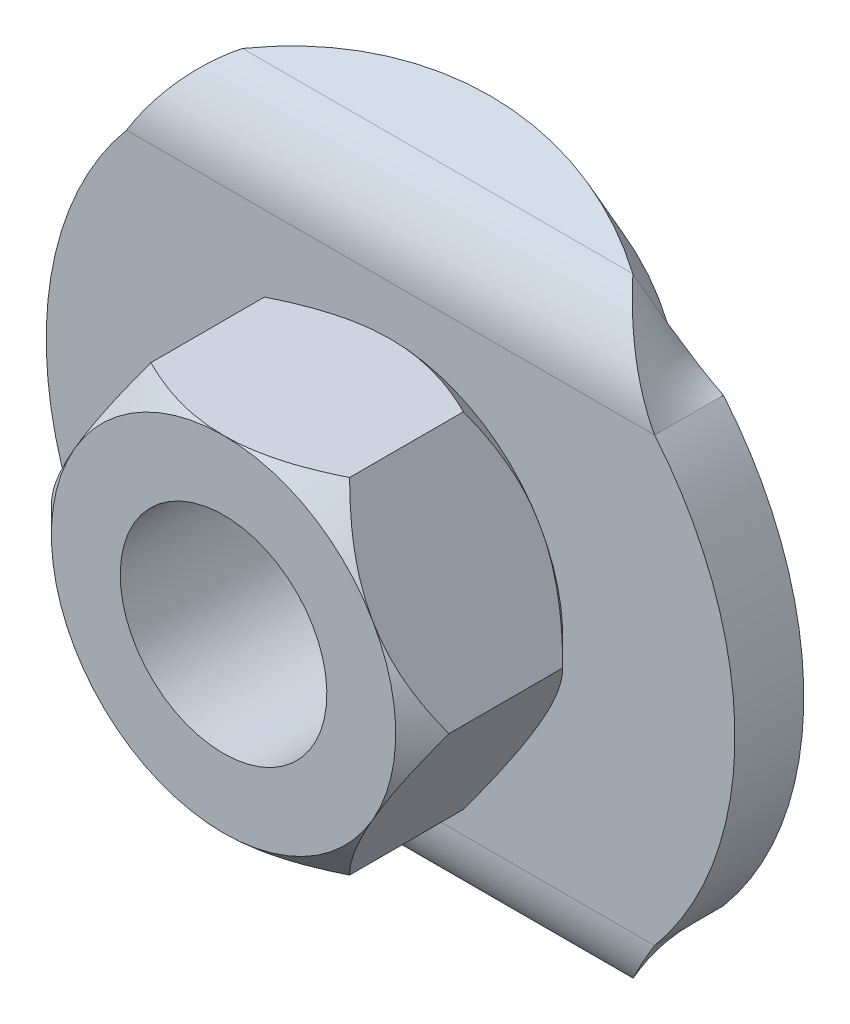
ISO-10303-21;
HEADER;
FILE_DESCRIPTION(('STEP AP214'),'2;1');
FILE_NAME('part.step','',(''),(''),'','','');
FILE_SCHEMA(('AUTOMOTIVE_DESIGN { 1 0 10303 214 1 1 1 1 }'));
ENDSEC;
DATA;
#1=APPLICATION_CONTEXT('core data for automotive mechanical design processes');
#2=APPLICATION_PROTOCOL_DEFINITION('international standard','automotive_design',2000,#1);
#3=PRODUCT_CONTEXT('',#1,'mechanical');
#4=PRODUCT('Part','Part','',(#3));
#5=PRODUCT_RELATED_PRODUCT_CATEGORY('part','',(#4));
#6=PRODUCT_DEFINITION_FORMATION('','',#4);
#7=PRODUCT_DEFINITION_CONTEXT('part definition',#1,'design');
#8=PRODUCT_DEFINITION('design','',#6,#7);
#9=PRODUCT_DEFINITION_SHAPE('','',#8);
#10=(LENGTH_UNIT() NAMED_UNIT(*) SI_UNIT(.MILLI.,.METRE.));
#11=(NAMED_UNIT(*) PLANE_ANGLE_UNIT() SI_UNIT($,.RADIAN.));
#12=(NAMED_UNIT(*) SI_UNIT($,.STERADIAN.) SOLID_ANGLE_UNIT());
#13=UNCERTAINTY_MEASURE_WITH_UNIT(LENGTH_MEASURE(1.E-05),#10,'distance_accuracy_value','');
#14=(GEOMETRIC_REPRESENTATION_CONTEXT(3) GLOBAL_UNCERTAINTY_ASSIGNED_CONTEXT((#13)) GLOBAL_UNIT_ASSIGNED_CONTEXT((#10,
#11,#12)) REPRESENTATION_CONTEXT('',''));
#15=CARTESIAN_POINT('',(0.,0.,0.));
#16=DIRECTION('',(0.,0.,1.));
#17=DIRECTION('',(1.,0.,0.));
#18=AXIS2_PLACEMENT_3D('',#15,#16,#17);
#19=CARTESIAN_POINT('',(0.,0.,0.));
#20=DIRECTION('',(0.,0.,1.));
#21=DIRECTION('',(-1.,0.,0.));
#22=AXIS2_PLACEMENT_3D('',#19,#20,#21);
#23=CYLINDRICAL_SURFACE('',#22,3.);
#24=CARTESIAN_POINT('',(0.,0.,0.));
#25=DIRECTION('',(0.,0.,-1.));
#26=DIRECTION('',(1.,0.,0.));
#27=AXIS2_PLACEMENT_3D('',#24,#25,#26);
#28=CIRCLE('',#27,3.);
#29=CARTESIAN_POINT('',(3.,0.,0.));
#30=VERTEX_POINT('',#29);
#31=EDGE_CURVE('E1101',#30,#30,#28,.T.);
#32=ORIENTED_EDGE('',*,*,#31,.T.);
#33=EDGE_LOOP('',(#32));
#34=FACE_BOUND('',#33,.T.);
#35=CARTESIAN_POINT('',(0.,0.,6.85));
#36=DIRECTION('',(0.,0.,1.));
#37=DIRECTION('',(-0.866025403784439,0.5,0.));
#38=AXIS2_PLACEMENT_3D('',#35,#36,#37);
#39=CIRCLE('',#38,3.);
#40=CARTESIAN_POINT('',(-2.59807621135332,1.49999999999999,6.85));
#41=VERTEX_POINT('',#40);
#42=EDGE_CURVE('E788',#41,#41,#39,.T.);
#43=ORIENTED_EDGE('',*,*,#42,.T.);
#44=EDGE_LOOP('',(#43));
#45=FACE_BOUND('',#44,.T.);
#46=ADVANCED_FACE('F14',(#34,#45),#23,.F.);
#47=CARTESIAN_POINT('',(0.,0.,0.));
#48=DIRECTION('',(0.,0.,1.));
#49=DIRECTION('',(-1.,0.,0.));
#50=AXIS2_PLACEMENT_3D('',#47,#48,#49);
#51=CYLINDRICAL_SURFACE('',#50,10.);
#52=CARTESIAN_POINT('',(0.,0.,0.));
#53=DIRECTION('',(0.,0.,-1.));
#54=DIRECTION('',(1.,0.,0.));
#55=AXIS2_PLACEMENT_3D('',#52,#53,#54);
#56=CIRCLE('',#55,10.);
#57=CARTESIAN_POINT('',(-7.66702689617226,-6.42002325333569,4.49398851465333E-09));
#58=VERTEX_POINT('',#57);
#59=CARTESIAN_POINT('',(-7.66702689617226,6.42002325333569,4.49400239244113E-09));
#60=VERTEX_POINT('',#59);
#61=EDGE_CURVE('E1375',#58,#60,#56,.T.);
#62=ORIENTED_EDGE('',*,*,#61,.F.);
#63=CARTESIAN_POINT('',(-7.66702689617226,-6.42002325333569,4.49398851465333E-09));
#64=CARTESIAN_POINT('',(-7.66702689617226,-6.42002325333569,0.666666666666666));
#65=CARTESIAN_POINT('',(-7.66702689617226,-6.42002325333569,1.3333333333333));
#66=CARTESIAN_POINT('',(-7.66702689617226,-6.42002325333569,2.));
#67=(BOUNDED_CURVE() B_SPLINE_CURVE(3,(#63,#64,#65,#66),.UNSPECIFIED.,.F.,
.F.) B_SPLINE_CURVE_WITH_KNOTS((4,4),(0.,1.),
.UNSPECIFIED.) CURVE() GEOMETRIC_REPRESENTATION_ITEM() RATIONAL_B_SPLINE_CURVE((1.,1.,1.,1.)) REPRESENTATION_ITEM(''));
#68=CARTESIAN_POINT('',(-7.66702689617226,-6.42002325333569,2.));
#69=VERTEX_POINT('',#68);
#70=EDGE_CURVE('E1389',#58,#69,#67,.T.);
#71=ORIENTED_EDGE('',*,*,#70,.T.);
#72=CARTESIAN_POINT('',(0.,0.,2.));
#73=DIRECTION('',(0.,0.,-1.));
#74=DIRECTION('',(1.,0.,0.));
#75=AXIS2_PLACEMENT_3D('',#72,#73,#74);
#76=CIRCLE('',#75,10.);
#77=CARTESIAN_POINT('',(-7.66702689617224,6.42002325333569,2.00000000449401));
#78=VERTEX_POINT('',#77);
#79=EDGE_CURVE('E1104',#69,#78,#76,.T.);
#80=ORIENTED_EDGE('',*,*,#79,.T.);
#81=CARTESIAN_POINT('',(-7.66702689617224,6.42002325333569,2.00000000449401));
#82=CARTESIAN_POINT('',(-7.66702689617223,6.42002325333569,1.33333333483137));
#83=CARTESIAN_POINT('',(-7.66702689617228,6.42002325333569,0.666666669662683));
#84=CARTESIAN_POINT('',(-7.66702689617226,6.42002325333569,4.49400239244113E-09));
#85=(BOUNDED_CURVE() B_SPLINE_CURVE(3,(#81,#82,#83,#84),.UNSPECIFIED.,.F.,
.F.) B_SPLINE_CURVE_WITH_KNOTS((4,4),(0.,1.),
.UNSPECIFIED.) CURVE() GEOMETRIC_REPRESENTATION_ITEM() RATIONAL_B_SPLINE_CURVE((1.,1.,1.,1.)) REPRESENTATION_ITEM(''));
#86=EDGE_CURVE('E1107',#78,#60,#85,.T.);
#87=ORIENTED_EDGE('',*,*,#86,.T.);
#88=EDGE_LOOP('',(#62,#71,#80,#87));
#89=FACE_BOUND('',#88,.T.);
#90=ADVANCED_FACE('F1332',(#89),#51,.T.);
#91=CARTESIAN_POINT('',(0.,0.,2.));
#92=DIRECTION('',(0.,0.,-1.));
#93=DIRECTION('',(1.,0.,0.));
#94=AXIS2_PLACEMENT_3D('',#91,#92,#93);
#95=PLANE('',#94);
#96=CARTESIAN_POINT('',(0.,0.,2.));
#97=DIRECTION('',(0.,0.,-1.));
#98=DIRECTION('',(-1.,0.,0.));
#99=AXIS2_PLACEMENT_3D('',#96,#97,#98);
#100=CIRCLE('',#99,5.);
#101=CARTESIAN_POINT('',(0.,-5.,2.));
#102=VERTEX_POINT('',#101);
#103=CARTESIAN_POINT('',(-4.33012701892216,-2.5,2.));
#104=VERTEX_POINT('',#103);
#105=EDGE_CURVE('E28',#102,#104,#100,.T.);
#106=ORIENTED_EDGE('',*,*,#105,.T.);
#107=CARTESIAN_POINT('',(0.,0.,2.));
#108=DIRECTION('',(0.,0.,-1.));
#109=DIRECTION('',(-1.,0.,0.));
#110=AXIS2_PLACEMENT_3D('',#107,#108,#109);
#111=CIRCLE('',#110,5.);
#112=CARTESIAN_POINT('',(-4.33012701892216,2.5,2.00000000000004));
#113=VERTEX_POINT('',#112);
#114=EDGE_CURVE('E9',#104,#113,#111,.T.);
#115=ORIENTED_EDGE('',*,*,#114,.T.);
#116=CARTESIAN_POINT('',(0.,0.,2.));
#117=DIRECTION('',(0.,0.,-1.));
#118=DIRECTION('',(-1.,0.,0.));
#119=AXIS2_PLACEMENT_3D('',#116,#117,#118);
#120=CIRCLE('',#119,5.);
#121=CARTESIAN_POINT('',(0.,5.,2.));
#122=VERTEX_POINT('',#121);
#123=EDGE_CURVE('E986',#113,#122,#120,.T.);
#124=ORIENTED_EDGE('',*,*,#123,.T.);
#125=CARTESIAN_POINT('',(0.,0.,2.));
#126=DIRECTION('',(0.,0.,-1.));
#127=DIRECTION('',(-1.,0.,0.));
#128=AXIS2_PLACEMENT_3D('',#125,#126,#127);
#129=CIRCLE('',#128,5.);
#130=CARTESIAN_POINT('',(4.33012701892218,2.5,2.00000000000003));
#131=VERTEX_POINT('',#130);
#132=EDGE_CURVE('E922',#122,#131,#129,.T.);
#133=ORIENTED_EDGE('',*,*,#132,.T.);
#134=CARTESIAN_POINT('',(0.,0.,2.));
#135=DIRECTION('',(0.,0.,-1.));
#136=DIRECTION('',(-1.,0.,0.));
#137=AXIS2_PLACEMENT_3D('',#134,#135,#136);
#138=CIRCLE('',#137,5.);
#139=CARTESIAN_POINT('',(4.33012701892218,-2.5,2.));
#140=VERTEX_POINT('',#139);
#141=EDGE_CURVE('E1002',#131,#140,#138,.T.);
#142=ORIENTED_EDGE('',*,*,#141,.T.);
#143=CARTESIAN_POINT('',(0.,0.,2.));
#144=DIRECTION('',(0.,0.,-1.));
#145=DIRECTION('',(-1.,0.,0.));
#146=AXIS2_PLACEMENT_3D('',#143,#144,#145);
#147=CIRCLE('',#146,5.);
#148=EDGE_CURVE('E1004',#140,#102,#147,.T.);
#149=ORIENTED_EDGE('',*,*,#148,.T.);
#150=EDGE_LOOP('',(#106,#115,#124,#133,#142,#149));
#151=FACE_BOUND('',#150,.T.);
#152=CARTESIAN_POINT('',(0.,0.,2.));
#153=DIRECTION('',(0.,0.,-1.));
#154=DIRECTION('',(1.,0.,0.));
#155=AXIS2_PLACEMENT_3D('',#152,#153,#154);
#156=CIRCLE('',#155,10.);
#157=CARTESIAN_POINT('',(7.66702689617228,6.42002325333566,2.00000000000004));
#158=VERTEX_POINT('',#157);
#159=CARTESIAN_POINT('',(7.6670268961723,-6.42002325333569,2.00000000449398));
#160=VERTEX_POINT('',#159);
#161=EDGE_CURVE('E1176',#158,#160,#156,.T.);
#162=ORIENTED_EDGE('',*,*,#161,.F.);
#163=DIRECTION('',(-1.,0.,0.));
#164=VECTOR('',#163,1.);
#165=CARTESIAN_POINT('',(0.,6.42002325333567,2.00000000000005));
#166=LINE('',#165,#164);
#167=EDGE_CURVE('E1181',#158,#78,#166,.T.);
#168=ORIENTED_EDGE('',*,*,#167,.T.);
#169=ORIENTED_EDGE('',*,*,#79,.F.);
#170=DIRECTION('',(1.,0.,0.));
#171=VECTOR('',#170,1.);
#172=CARTESIAN_POINT('',(0.,-6.42002325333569,2.));
#173=LINE('',#172,#171);
#174=EDGE_CURVE('E1175',#69,#160,#173,.T.);
#175=ORIENTED_EDGE('',*,*,#174,.T.);
#176=EDGE_LOOP('',(#162,#168,#169,#175));
#177=FACE_BOUND('',#176,.T.);
#178=ADVANCED_FACE('F983',(#151,#177),#95,.F.);
#179=CARTESIAN_POINT('',(0.,0.,0.));
#180=DIRECTION('',(0.,0.,1.));
#181=DIRECTION('',(-1.,0.,0.));
#182=AXIS2_PLACEMENT_3D('',#179,#180,#181);
#183=CYLINDRICAL_SURFACE('',#182,10.);
#184=CARTESIAN_POINT('',(0.,0.,0.));
#185=DIRECTION('',(0.,0.,-1.));
#186=DIRECTION('',(1.,0.,0.));
#187=AXIS2_PLACEMENT_3D('',#184,#185,#186);
#188=CIRCLE('',#187,10.);
#189=CARTESIAN_POINT('',(7.66702689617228,6.42002325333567,4.49398504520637E-09));
#190=VERTEX_POINT('',#189);
#191=CARTESIAN_POINT('',(7.66702689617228,-6.42002325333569,4.49397463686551E-09));
#192=VERTEX_POINT('',#191);
#193=EDGE_CURVE('E1393',#190,#192,#188,.T.);
#194=ORIENTED_EDGE('',*,*,#193,.F.);
#195=CARTESIAN_POINT('',(7.66702689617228,6.42002325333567,4.49398504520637E-09));
#196=CARTESIAN_POINT('',(7.66702689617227,6.42002325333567,0.66666666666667));
#197=CARTESIAN_POINT('',(7.66702689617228,6.42002325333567,1.33333333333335));
#198=CARTESIAN_POINT('',(7.66702689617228,6.42002325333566,2.00000000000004));
#199=(BOUNDED_CURVE() B_SPLINE_CURVE(3,(#195,#196,#197,#198),.UNSPECIFIED.,.F.,
.F.) B_SPLINE_CURVE_WITH_KNOTS((4,4),(0.,1.),
.UNSPECIFIED.) CURVE() GEOMETRIC_REPRESENTATION_ITEM() RATIONAL_B_SPLINE_CURVE((1.,1.,1.,1.)) REPRESENTATION_ITEM(''));
#200=EDGE_CURVE('E1171',#190,#158,#199,.T.);
#201=ORIENTED_EDGE('',*,*,#200,.T.);
#202=ORIENTED_EDGE('',*,*,#161,.T.);
#203=CARTESIAN_POINT('',(7.6670268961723,-6.42002325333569,2.00000000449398));
#204=CARTESIAN_POINT('',(7.66702689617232,-6.42002325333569,1.33333333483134));
#205=CARTESIAN_POINT('',(7.66702689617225,-6.42002325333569,0.666666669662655));
#206=CARTESIAN_POINT('',(7.66702689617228,-6.42002325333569,4.49397463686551E-09));
#207=(BOUNDED_CURVE() B_SPLINE_CURVE(3,(#203,#204,#205,#206),.UNSPECIFIED.,.F.,
.F.) B_SPLINE_CURVE_WITH_KNOTS((4,4),(0.,1.),
.UNSPECIFIED.) CURVE() GEOMETRIC_REPRESENTATION_ITEM() RATIONAL_B_SPLINE_CURVE((1.,1.,1.,1.)) REPRESENTATION_ITEM(''));
#208=EDGE_CURVE('E1279',#160,#192,#207,.T.);
#209=ORIENTED_EDGE('',*,*,#208,.T.);
#210=EDGE_LOOP('',(#194,#201,#202,#209));
#211=FACE_BOUND('',#210,.T.);
#212=ADVANCED_FACE('F1254',(#211),#183,.T.);
#213=CARTESIAN_POINT('',(0.,0.,0.));
#214=DIRECTION('',(0.,0.,-1.));
#215=DIRECTION('',(1.,0.,0.));
#216=AXIS2_PLACEMENT_3D('',#213,#214,#215);
#217=PLANE('',#216);
#218=DIRECTION('',(-1.,0.,0.));
#219=VECTOR('',#218,1.);
#220=CARTESIAN_POINT('',(0.,6.42002325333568,0.));
#221=LINE('',#220,#219);
#222=EDGE_CURVE('E1505',#190,#60,#221,.T.);
#223=ORIENTED_EDGE('',*,*,#222,.F.);
#224=ORIENTED_EDGE('',*,*,#193,.T.);
#225=DIRECTION('',(1.,0.,0.));
#226=VECTOR('',#225,1.);
#227=CARTESIAN_POINT('',(0.,-6.42002325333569,0.));
#228=LINE('',#227,#226);
#229=EDGE_CURVE('E1476',#58,#192,#228,.T.);
#230=ORIENTED_EDGE('',*,*,#229,.F.);
#231=ORIENTED_EDGE('',*,*,#61,.T.);
#232=EDGE_LOOP('',(#223,#224,#230,#231));
#233=FACE_BOUND('',#232,.T.);
#234=ORIENTED_EDGE('',*,*,#31,.F.);
#235=EDGE_LOOP('',(#234));
#236=FACE_BOUND('',#235,.T.);
#237=ADVANCED_FACE('F1329',(#233,#236),#217,.T.);
#238=CARTESIAN_POINT('',(-5.66795308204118,-8.78998837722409,0.631700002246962));
#239=CARTESIAN_POINT('',(-5.89681194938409,-8.64591131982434,0.881248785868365));
#240=CARTESIAN_POINT('',(-6.10991455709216,-8.46888939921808,1.09657074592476));
#241=CARTESIAN_POINT('',(-6.5052549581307,-8.08160135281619,1.45372547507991));
#242=CARTESIAN_POINT('',(-6.68738480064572,-7.87151274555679,1.59560704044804));
#243=CARTESIAN_POINT('',(-7.18715325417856,-7.23264644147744,1.91985449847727));
#244=CARTESIAN_POINT('',(-7.45898194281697,-6.79776767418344,2.00000000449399));
#245=CARTESIAN_POINT('',(-7.66702689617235,-6.42002325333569,2.00000000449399));
#246=CARTESIAN_POINT('',(-5.66795308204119,-7.05793756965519,-0.368299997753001));
#247=CARTESIAN_POINT('',(-5.89672213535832,-7.01917212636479,-0.301156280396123));
#248=CARTESIAN_POINT('',(-6.10991455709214,-6.97150860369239,-0.243172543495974));
#249=CARTESIAN_POINT('',(-6.5052549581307,-6.86726378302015,-0.147038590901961));
#250=CARTESIAN_POINT('',(-6.68738480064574,-6.81071504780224,-0.108848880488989));
#251=CARTESIAN_POINT('',(-7.18715325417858,-6.63875388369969,-0.0215724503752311));
#252=CARTESIAN_POINT('',(-7.45837461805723,-6.52199606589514,4.49396422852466E-09));
#253=CARTESIAN_POINT('',(-7.66702689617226,-6.42002325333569,4.49398851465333E-09));
#254=(BOUNDED_SURFACE() B_SPLINE_SURFACE(1,3,((#238,#239,#240,#241,#242,#243,#244,#245),(#246,
#247,#248,#249,#250,#251,#252,#253)),.UNSPECIFIED.,.F.,.F.,.F.) B_SPLINE_SURFACE_WITH_KNOTS((2,
2),(4,2,2,4),(0.,1.),(0.,0.25,0.5,1.),
.UNSPECIFIED.) GEOMETRIC_REPRESENTATION_ITEM() RATIONAL_B_SPLINE_SURFACE(((1.,1.,1.,1.,1.,1.,1.,
1.),(1.,1.,1.,1.,1.,1.,1.,1.))) REPRESENTATION_ITEM('') SURFACE());
#255=CARTESIAN_POINT('',(-5.66795308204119,-7.05793756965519,-0.368299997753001));
#256=CARTESIAN_POINT('',(-5.66795308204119,-8.78998837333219,0.631700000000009));
#257=(BOUNDED_CURVE() B_SPLINE_CURVE(1,(#255,#256),.UNSPECIFIED.,.F.,
.F.) B_SPLINE_CURVE_WITH_KNOTS((2,2),(0.,1.),
.UNSPECIFIED.) CURVE() GEOMETRIC_REPRESENTATION_ITEM() RATIONAL_B_SPLINE_CURVE((1.,1.)) REPRESENTATION_ITEM(''));
#258=CARTESIAN_POINT('',(-5.66795308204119,-7.05793756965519,-0.368299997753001));
#259=VERTEX_POINT('',#258);
#260=CARTESIAN_POINT('',(-5.66795308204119,-8.78998837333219,0.631700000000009));
#261=VERTEX_POINT('',#260);
#262=EDGE_CURVE('E1372',#259,#261,#257,.T.);
#263=CARTESIAN_POINT('',(-5.66795308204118,-8.78998837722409,0.631700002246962));
#264=CARTESIAN_POINT('',(-5.89681194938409,-8.64591131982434,0.881248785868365));
#265=CARTESIAN_POINT('',(-6.10991455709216,-8.46888939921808,1.09657074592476));
#266=CARTESIAN_POINT('',(-6.5052549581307,-8.08160135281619,1.45372547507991));
#267=CARTESIAN_POINT('',(-6.68738480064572,-7.87151274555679,1.59560704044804));
#268=CARTESIAN_POINT('',(-7.18715325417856,-7.23264644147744,1.91985449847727));
#269=CARTESIAN_POINT('',(-7.45898194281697,-6.79776767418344,2.00000000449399));
#270=CARTESIAN_POINT('',(-7.66702689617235,-6.42002325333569,2.00000000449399));
#271=(BOUNDED_CURVE() B_SPLINE_CURVE(3,(#263,#264,#265,#266,#267,#268,#269,#270),.UNSPECIFIED.,
.F.,.F.) B_SPLINE_CURVE_WITH_KNOTS((4,2,2,4),(0.,0.25,0.5,1.),
.UNSPECIFIED.) CURVE() GEOMETRIC_REPRESENTATION_ITEM() RATIONAL_B_SPLINE_CURVE((1.,1.,1.,1.,1.,
1.,1.,1.)) REPRESENTATION_ITEM(''));
#272=EDGE_CURVE('E1355',#261,#69,#271,.T.);
#273=CARTESIAN_POINT('',(-7.66702689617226,-6.42002325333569,4.49398851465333E-09));
#274=CARTESIAN_POINT('',(-7.45837461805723,-6.52199606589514,4.49396422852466E-09));
#275=CARTESIAN_POINT('',(-7.18715325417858,-6.63875388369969,-0.0215724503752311));
#276=CARTESIAN_POINT('',(-6.68738480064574,-6.81071504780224,-0.108848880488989));
#277=CARTESIAN_POINT('',(-6.5052549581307,-6.86726378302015,-0.147038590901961));
#278=CARTESIAN_POINT('',(-6.10991455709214,-6.97150860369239,-0.243172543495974));
#279=CARTESIAN_POINT('',(-5.89672213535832,-7.01917212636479,-0.301156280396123));
#280=CARTESIAN_POINT('',(-5.66795308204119,-7.05793756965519,-0.368299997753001));
#281=(BOUNDED_CURVE() B_SPLINE_CURVE(3,(#273,#274,#275,#276,#277,#278,#279,#280),.UNSPECIFIED.,
.F.,.F.) B_SPLINE_CURVE_WITH_KNOTS((4,2,2,4),(0.,0.5,0.75,1.),
.UNSPECIFIED.) CURVE() GEOMETRIC_REPRESENTATION_ITEM() RATIONAL_B_SPLINE_CURVE((1.,1.,1.,1.,1.,
1.,1.,1.)) REPRESENTATION_ITEM(''));
#282=EDGE_CURVE('E1439',#259,#58,#281,.F.);
#283=ORIENTED_EDGE('',*,*,#262,.T.);
#284=ORIENTED_EDGE('',*,*,#272,.T.);
#285=ORIENTED_EDGE('',*,*,#70,.F.);
#286=ORIENTED_EDGE('',*,*,#282,.F.);
#287=EDGE_LOOP('',(#283,#284,#285,#286));
#288=FACE_BOUND('',#287,.T.);
#289=ADVANCED_FACE('F1316',(#288),#254,.F.);
#290=CARTESIAN_POINT('',(15.570497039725,-6.4200232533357,-0.736600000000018));
#291=DIRECTION('',(-1.,0.,0.));
#292=DIRECTION('',(0.,0.,-1.));
#293=AXIS2_PLACEMENT_3D('',#290,#291,#292);
#294=CYLINDRICAL_SURFACE('',#293,0.736600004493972);
#295=ORIENTED_EDGE('',*,*,#229,.T.);
#296=CARTESIAN_POINT('',(5.6679530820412,-7.05793756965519,-0.368299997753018));
#297=CARTESIAN_POINT('',(5.80588371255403,-7.03655708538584,-0.331267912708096));
#298=CARTESIAN_POINT('',(5.95099883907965,-7.00923959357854,-0.291326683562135));
#299=CARTESIAN_POINT('',(6.25553025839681,-6.93868187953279,-0.210826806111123));
#300=CARTESIAN_POINT('',(6.41495785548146,-6.89538087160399,-0.170254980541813));
#301=CARTESIAN_POINT('',(6.74813682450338,-6.79009669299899,-0.0964772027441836));
#302=CARTESIAN_POINT('',(6.92188819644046,-6.72803518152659,-0.0632954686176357));
#303=CARTESIAN_POINT('',(7.28371471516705,-6.58593593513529,-0.0150161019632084));
#304=CARTESIAN_POINT('',(7.47174915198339,-6.50583762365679,4.49398851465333E-09));
#305=CARTESIAN_POINT('',(7.66702689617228,-6.42002325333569,4.49397463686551E-09));
#306=(BOUNDED_CURVE() B_SPLINE_CURVE(3,(#296,#297,#298,#299,#300,#301,#302,#303,#304,#305),
.UNSPECIFIED.,.F.,.F.) B_SPLINE_CURVE_WITH_KNOTS((4,2,2,2,4),(0.,0.25,0.5,0.75,1.),
.UNSPECIFIED.) CURVE() GEOMETRIC_REPRESENTATION_ITEM() RATIONAL_B_SPLINE_CURVE((1.,1.,1.,1.,1.,
1.,1.,1.,1.,1.)) REPRESENTATION_ITEM(''));
#307=CARTESIAN_POINT('',(5.66795308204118,-7.05793756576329,-0.36830000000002));
#308=VERTEX_POINT('',#307);
#309=EDGE_CURVE('E1413',#192,#308,#306,.F.);
#310=ORIENTED_EDGE('',*,*,#309,.T.);
#311=DIRECTION('',(1.,0.,0.));
#312=VECTOR('',#311,1.);
#313=CARTESIAN_POINT('',(0.,-7.05793756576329,-0.368300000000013));
#314=LINE('',#313,#312);
#315=EDGE_CURVE('E1386',#259,#308,#314,.T.);
#316=ORIENTED_EDGE('',*,*,#315,.F.);
#317=ORIENTED_EDGE('',*,*,#282,.T.);
#318=EDGE_LOOP('',(#295,#310,#316,#317));
#319=FACE_BOUND('',#318,.T.);
#320=ADVANCED_FACE('F1328',(#319),#294,.F.);
#321=CARTESIAN_POINT('',(7.6670268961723,-6.42002325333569,2.00000000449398));
#322=CARTESIAN_POINT('',(7.47160696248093,-6.73907104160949,2.00000000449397));
#323=CARTESIAN_POINT('',(7.28371471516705,-7.03641837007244,1.94421249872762));
#324=CARTESIAN_POINT('',(6.92188819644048,-7.56434233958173,1.76484606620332));
#325=CARTESIAN_POINT('',(6.74813682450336,-7.79491189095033,1.64157002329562));
#326=CARTESIAN_POINT('',(6.41495785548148,-8.18606133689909,1.36747245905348));
#327=CARTESIAN_POINT('',(6.25553025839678,-8.34693228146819,1.21674091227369));
#328=CARTESIAN_POINT('',(5.95099883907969,-8.60906673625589,0.917669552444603));
#329=CARTESIAN_POINT('',(5.80582150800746,-8.71059189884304,0.769218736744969));
#330=CARTESIAN_POINT('',(5.6679530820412,-8.78998837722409,0.63170000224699));
#331=CARTESIAN_POINT('',(7.66702689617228,-6.42002325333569,4.49397463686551E-09));
#332=CARTESIAN_POINT('',(7.47174915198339,-6.50583762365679,4.49398851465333E-09));
#333=CARTESIAN_POINT('',(7.28371471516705,-6.58593593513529,-0.0150161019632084));
#334=CARTESIAN_POINT('',(6.92188819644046,-6.72803518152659,-0.0632954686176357));
#335=CARTESIAN_POINT('',(6.74813682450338,-6.79009669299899,-0.0964772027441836));
#336=CARTESIAN_POINT('',(6.41495785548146,-6.89538087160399,-0.170254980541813));
#337=CARTESIAN_POINT('',(6.25553025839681,-6.93868187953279,-0.210826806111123));
#338=CARTESIAN_POINT('',(5.95099883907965,-7.00923959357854,-0.291326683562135));
#339=CARTESIAN_POINT('',(5.80588371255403,-7.03655708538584,-0.331267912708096));
#340=CARTESIAN_POINT('',(5.6679530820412,-7.05793756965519,-0.368299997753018));
#341=(BOUNDED_SURFACE() B_SPLINE_SURFACE(1,3,((#321,#322,#323,#324,#325,#326,#327,#328,#329,
#330),(#331,#332,#333,#334,#335,#336,#337,#338,#339,#340)),.UNSPECIFIED.,.F.,.F.,
.F.) B_SPLINE_SURFACE_WITH_KNOTS((2,2),(4,2,2,2,4),(0.,1.),(0.,0.25,0.5,0.75,1.),
.UNSPECIFIED.) GEOMETRIC_REPRESENTATION_ITEM() RATIONAL_B_SPLINE_SURFACE(((1.,1.,1.,1.,1.,1.,1.,
1.,1.,1.),(1.,1.,1.,1.,1.,1.,1.,1.,1.,1.))) REPRESENTATION_ITEM('') SURFACE());
#342=CARTESIAN_POINT('',(7.6670268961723,-6.42002325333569,2.00000000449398));
#343=CARTESIAN_POINT('',(7.47160696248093,-6.73907104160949,2.00000000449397));
#344=CARTESIAN_POINT('',(7.28371471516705,-7.03641837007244,1.94421249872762));
#345=CARTESIAN_POINT('',(6.92188819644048,-7.56434233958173,1.76484606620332));
#346=CARTESIAN_POINT('',(6.74813682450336,-7.79491189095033,1.64157002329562));
#347=CARTESIAN_POINT('',(6.41495785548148,-8.18606133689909,1.36747245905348));
#348=CARTESIAN_POINT('',(6.25553025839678,-8.34693228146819,1.21674091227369));
#349=CARTESIAN_POINT('',(5.95099883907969,-8.60906673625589,0.917669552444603));
#350=CARTESIAN_POINT('',(5.80582150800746,-8.71059189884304,0.769218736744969));
#351=CARTESIAN_POINT('',(5.6679530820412,-8.78998837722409,0.63170000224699));
#352=(BOUNDED_CURVE() B_SPLINE_CURVE(3,(#342,#343,#344,#345,#346,#347,#348,#349,#350,#351),
.UNSPECIFIED.,.F.,.F.) B_SPLINE_CURVE_WITH_KNOTS((4,2,2,2,4),(0.,0.25,0.5,0.75,1.),
.UNSPECIFIED.) CURVE() GEOMETRIC_REPRESENTATION_ITEM() RATIONAL_B_SPLINE_CURVE((1.,1.,1.,1.,1.,
1.,1.,1.,1.,1.)) REPRESENTATION_ITEM(''));
#353=CARTESIAN_POINT('',(5.66795308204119,-8.78998837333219,0.631699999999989));
#354=VERTEX_POINT('',#353);
#355=EDGE_CURVE('E1295',#160,#354,#352,.T.);
#356=CARTESIAN_POINT('',(5.66795308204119,-8.78998837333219,0.631699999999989));
#357=CARTESIAN_POINT('',(5.66795308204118,-7.05793756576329,-0.36830000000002));
#358=(BOUNDED_CURVE() B_SPLINE_CURVE(1,(#356,#357),.UNSPECIFIED.,.F.,
.F.) B_SPLINE_CURVE_WITH_KNOTS((2,2),(0.,1.),
.UNSPECIFIED.) CURVE() GEOMETRIC_REPRESENTATION_ITEM() RATIONAL_B_SPLINE_CURVE((1.,1.)) REPRESENTATION_ITEM(''));
#359=EDGE_CURVE('E1368',#354,#308,#358,.T.);
#360=ORIENTED_EDGE('',*,*,#355,.T.);
#361=ORIENTED_EDGE('',*,*,#359,.T.);
#362=ORIENTED_EDGE('',*,*,#309,.F.);
#363=ORIENTED_EDGE('',*,*,#208,.F.);
#364=EDGE_LOOP('',(#360,#361,#362,#363));
#365=FACE_BOUND('',#364,.T.);
#366=ADVANCED_FACE('F1212',(#365),#341,.F.);
#367=CARTESIAN_POINT('',(15.570497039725,-6.4200232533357,-0.736600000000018));
#368=DIRECTION('',(-1.,0.,0.));
#369=DIRECTION('',(0.,0.,-1.));
#370=AXIS2_PLACEMENT_3D('',#367,#368,#369);
#371=CYLINDRICAL_SURFACE('',#370,2.73660000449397);
#372=ORIENTED_EDGE('',*,*,#174,.F.);
#373=ORIENTED_EDGE('',*,*,#272,.F.);
#374=DIRECTION('',(1.,0.,0.));
#375=VECTOR('',#374,1.);
#376=CARTESIAN_POINT('',(0.,-8.78998837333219,0.6317));
#377=LINE('',#376,#375);
#378=EDGE_CURVE('E1360',#261,#354,#377,.T.);
#379=ORIENTED_EDGE('',*,*,#378,.T.);
#380=ORIENTED_EDGE('',*,*,#355,.F.);
#381=EDGE_LOOP('',(#372,#373,#379,#380));
#382=FACE_BOUND('',#381,.T.);
#383=ADVANCED_FACE('F1127',(#382),#371,.T.);
#384=CARTESIAN_POINT('',(0.,-2.93864430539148,6.76652521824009));
#385=DIRECTION('',(0.,0.866025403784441,-0.5));
#386=DIRECTION('',(-1.,0.,0.));
#387=AXIS2_PLACEMENT_3D('',#384,#385,#386);
#388=PLANE('',#387);
#389=CARTESIAN_POINT('',(0.,-2.93864430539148,6.76652521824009));
#390=DIRECTION('',(0.,0.866025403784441,-0.5));
#391=DIRECTION('',(1.,0.,0.));
#392=AXIS2_PLACEMENT_3D('',#389,#390,#391);
#393=CIRCLE('',#392,10.);
#394=EDGE_CURVE('E1369',#308,#259,#393,.T.);
#395=ORIENTED_EDGE('',*,*,#394,.T.);
#396=ORIENTED_EDGE('',*,*,#315,.T.);
#397=EDGE_LOOP('',(#395,#396));
#398=FACE_BOUND('',#397,.T.);
#399=ADVANCED_FACE('F1630',(#398),#388,.T.);
#400=CARTESIAN_POINT('',(0.,-2.93864430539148,6.76652521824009));
#401=DIRECTION('',(0.,-0.866025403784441,0.5));
#402=DIRECTION('',(-1.,0.,0.));
#403=AXIS2_PLACEMENT_3D('',#400,#401,#402);
#404=CYLINDRICAL_SURFACE('',#403,10.);
#405=ORIENTED_EDGE('',*,*,#262,.F.);
#406=ORIENTED_EDGE('',*,*,#394,.F.);
#407=ORIENTED_EDGE('',*,*,#359,.F.);
#408=CARTESIAN_POINT('',(0.,-4.67069511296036,7.7665252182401));
#409=DIRECTION('',(0.,0.866025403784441,-0.5));
#410=DIRECTION('',(1.,0.,0.));
#411=AXIS2_PLACEMENT_3D('',#408,#409,#410);
#412=CIRCLE('',#411,10.);
#413=EDGE_CURVE('E1156',#354,#261,#412,.T.);
#414=ORIENTED_EDGE('',*,*,#413,.T.);
#415=EDGE_LOOP('',(#405,#406,#407,#414));
#416=FACE_BOUND('',#415,.T.);
#417=ADVANCED_FACE('F1617',(#416),#404,.T.);
#418=CARTESIAN_POINT('',(0.,-4.67069511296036,7.7665252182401));
#419=DIRECTION('',(0.,0.866025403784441,-0.5));
#420=DIRECTION('',(-1.,0.,0.));
#421=AXIS2_PLACEMENT_3D('',#418,#419,#420);
#422=PLANE('',#421);
#423=ORIENTED_EDGE('',*,*,#378,.F.);
#424=ORIENTED_EDGE('',*,*,#413,.F.);
#425=EDGE_LOOP('',(#423,#424));
#426=FACE_BOUND('',#425,.T.);
#427=ADVANCED_FACE('F1253',(#426),#422,.F.);
#428=CARTESIAN_POINT('',(5.6679530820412,8.78998837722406,0.631700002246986));
#429=CARTESIAN_POINT('',(5.89680730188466,8.64591424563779,0.881243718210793));
#430=CARTESIAN_POINT('',(6.10990645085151,8.46889604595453,1.09656289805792));
#431=CARTESIAN_POINT('',(6.5052422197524,8.08161399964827,1.45371553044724));
#432=CARTESIAN_POINT('',(6.68737090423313,7.87152765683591,1.59559776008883));
#433=CARTESIAN_POINT('',(7.18713935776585,7.23266342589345,1.91984930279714));
#434=CARTESIAN_POINT('',(7.45897259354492,6.79777951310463,2.00000000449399));
#435=CARTESIAN_POINT('',(7.6670268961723,6.42002325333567,2.00000000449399));
#436=CARTESIAN_POINT('',(5.6679530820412,7.05793756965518,-0.368299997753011));
#437=CARTESIAN_POINT('',(5.89671750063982,7.01917291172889,-0.301157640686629));
#438=CARTESIAN_POINT('',(6.10990645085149,6.97151039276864,-0.243174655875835));
#439=CARTESIAN_POINT('',(6.50524221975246,6.86726718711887,-0.147041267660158));
#440=CARTESIAN_POINT('',(6.68737090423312,6.8107190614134,-0.108851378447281));
#441=CARTESIAN_POINT('',(7.18713935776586,6.63875845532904,-0.0215738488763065));
#442=CARTESIAN_POINT('',(7.45836532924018,6.52199921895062,4.49399198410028E-09));
#443=CARTESIAN_POINT('',(7.66702689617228,6.42002325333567,4.49398504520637E-09));
#444=(BOUNDED_SURFACE() B_SPLINE_SURFACE(1,3,((#428,#429,#430,#431,#432,#433,#434,#435),(#436,
#437,#438,#439,#440,#441,#442,#443)),.UNSPECIFIED.,.F.,.F.,.F.) B_SPLINE_SURFACE_WITH_KNOTS((2,
2),(4,2,2,4),(0.,1.),(0.,0.25,0.5,1.),
.UNSPECIFIED.) GEOMETRIC_REPRESENTATION_ITEM() RATIONAL_B_SPLINE_SURFACE(((1.,1.,1.,1.,1.,1.,1.,
1.),(1.,1.,1.,1.,1.,1.,1.,1.))) REPRESENTATION_ITEM('') SURFACE());
#445=CARTESIAN_POINT('',(5.6679530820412,7.05793756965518,-0.368299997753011));
#446=CARTESIAN_POINT('',(5.66795308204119,8.78998837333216,0.631700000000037));
#447=(BOUNDED_CURVE() B_SPLINE_CURVE(1,(#445,#446),.UNSPECIFIED.,.F.,
.F.) B_SPLINE_CURVE_WITH_KNOTS((2,2),(0.,1.),
.UNSPECIFIED.) CURVE() GEOMETRIC_REPRESENTATION_ITEM() RATIONAL_B_SPLINE_CURVE((1.,1.)) REPRESENTATION_ITEM(''));
#448=CARTESIAN_POINT('',(5.6679530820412,7.05793756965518,-0.368299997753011));
#449=VERTEX_POINT('',#448);
#450=CARTESIAN_POINT('',(5.66795308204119,8.78998837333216,0.631700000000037));
#451=VERTEX_POINT('',#450);
#452=EDGE_CURVE('E1152',#449,#451,#447,.T.);
#453=CARTESIAN_POINT('',(5.6679530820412,8.78998837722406,0.631700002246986));
#454=CARTESIAN_POINT('',(5.89680730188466,8.64591424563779,0.881243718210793));
#455=CARTESIAN_POINT('',(6.10990645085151,8.46889604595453,1.09656289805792));
#456=CARTESIAN_POINT('',(6.5052422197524,8.08161399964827,1.45371553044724));
#457=CARTESIAN_POINT('',(6.68737090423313,7.87152765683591,1.59559776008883));
#458=CARTESIAN_POINT('',(7.18713935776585,7.23266342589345,1.91984930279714));
#459=CARTESIAN_POINT('',(7.45897259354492,6.79777951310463,2.00000000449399));
#460=CARTESIAN_POINT('',(7.6670268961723,6.42002325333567,2.00000000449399));
#461=(BOUNDED_CURVE() B_SPLINE_CURVE(3,(#453,#454,#455,#456,#457,#458,#459,#460),.UNSPECIFIED.,
.F.,.F.) B_SPLINE_CURVE_WITH_KNOTS((4,2,2,4),(0.,0.25,0.5,1.),
.UNSPECIFIED.) CURVE() GEOMETRIC_REPRESENTATION_ITEM() RATIONAL_B_SPLINE_CURVE((1.,1.,1.,1.,1.,
1.,1.,1.)) REPRESENTATION_ITEM(''));
#462=EDGE_CURVE('E1157',#451,#158,#461,.T.);
#463=CARTESIAN_POINT('',(7.66702689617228,6.42002325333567,4.49398504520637E-09));
#464=CARTESIAN_POINT('',(7.45836532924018,6.52199921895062,4.49399198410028E-09));
#465=CARTESIAN_POINT('',(7.18713935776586,6.63875845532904,-0.0215738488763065));
#466=CARTESIAN_POINT('',(6.68737090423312,6.8107190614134,-0.108851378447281));
#467=CARTESIAN_POINT('',(6.50524221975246,6.86726718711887,-0.147041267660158));
#468=CARTESIAN_POINT('',(6.10990645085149,6.97151039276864,-0.243174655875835));
#469=CARTESIAN_POINT('',(5.89671750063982,7.01917291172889,-0.301157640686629));
#470=CARTESIAN_POINT('',(5.6679530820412,7.05793756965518,-0.368299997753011));
#471=(BOUNDED_CURVE() B_SPLINE_CURVE(3,(#463,#464,#465,#466,#467,#468,#469,#470),.UNSPECIFIED.,
.F.,.F.) B_SPLINE_CURVE_WITH_KNOTS((4,2,2,4),(0.,0.5,0.75,1.),
.UNSPECIFIED.) CURVE() GEOMETRIC_REPRESENTATION_ITEM() RATIONAL_B_SPLINE_CURVE((1.,1.,1.,1.,1.,
1.,1.,1.)) REPRESENTATION_ITEM(''));
#472=EDGE_CURVE('E1235',#449,#190,#471,.F.);
#473=ORIENTED_EDGE('',*,*,#452,.T.);
#474=ORIENTED_EDGE('',*,*,#462,.T.);
#475=ORIENTED_EDGE('',*,*,#200,.F.);
#476=ORIENTED_EDGE('',*,*,#472,.F.);
#477=EDGE_LOOP('',(#473,#474,#475,#476));
#478=FACE_BOUND('',#477,.T.);
#479=ADVANCED_FACE('F1211',(#478),#444,.F.);
#480=CARTESIAN_POINT('',(-15.570497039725,6.4200232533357,-0.736599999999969));
#481=DIRECTION('',(1.,0.,0.));
#482=DIRECTION('',(0.,0.,1.));
#483=AXIS2_PLACEMENT_3D('',#480,#481,#482);
#484=CYLINDRICAL_SURFACE('',#483,0.736600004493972);
#485=ORIENTED_EDGE('',*,*,#222,.T.);
#486=CARTESIAN_POINT('',(-5.66795308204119,7.0579375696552,-0.36829999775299));
#487=CARTESIAN_POINT('',(-5.80586200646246,7.03656045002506,-0.331273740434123));
#488=CARTESIAN_POINT('',(-5.95096085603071,7.00924652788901,-0.291336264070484));
#489=CARTESIAN_POINT('',(-6.25547057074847,6.93869490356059,-0.210839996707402));
#490=CARTESIAN_POINT('',(-6.41489274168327,6.89539639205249,-0.170268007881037));
#491=CARTESIAN_POINT('',(-6.7480717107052,6.7901142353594,-0.0964873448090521));
#492=CARTESIAN_POINT('',(-6.92182850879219,6.72805220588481,-0.0633028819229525));
#493=CARTESIAN_POINT('',(-7.28367673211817,6.58594758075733,-0.0150184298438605));
#494=CARTESIAN_POINT('',(-7.47172743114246,6.50584435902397,4.49397116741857E-09));
#495=CARTESIAN_POINT('',(-7.66702689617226,6.42002325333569,4.49400239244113E-09));
#496=(BOUNDED_CURVE() B_SPLINE_CURVE(3,(#486,#487,#488,#489,#490,#491,#492,#493,#494,#495),
.UNSPECIFIED.,.F.,.F.) B_SPLINE_CURVE_WITH_KNOTS((4,2,2,2,4),(0.,0.25,0.5,0.75,1.),
.UNSPECIFIED.) CURVE() GEOMETRIC_REPRESENTATION_ITEM() RATIONAL_B_SPLINE_CURVE((1.,1.,1.,1.,1.,
1.,1.,1.,1.,1.)) REPRESENTATION_ITEM(''));
#497=CARTESIAN_POINT('',(-5.6679530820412,7.05793756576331,-0.368299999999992));
#498=VERTEX_POINT('',#497);
#499=EDGE_CURVE('E1196',#60,#498,#496,.F.);
#500=ORIENTED_EDGE('',*,*,#499,.T.);
#501=DIRECTION('',(-1.,0.,0.));
#502=VECTOR('',#501,1.);
#503=CARTESIAN_POINT('',(0.,7.0579375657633,-0.3683));
#504=LINE('',#503,#502);
#505=EDGE_CURVE('E1168',#449,#498,#504,.T.);
#506=ORIENTED_EDGE('',*,*,#505,.F.);
#507=ORIENTED_EDGE('',*,*,#472,.T.);
#508=EDGE_LOOP('',(#485,#500,#506,#507));
#509=FACE_BOUND('',#508,.T.);
#510=ADVANCED_FACE('F1202',(#509),#484,.F.);
#511=CARTESIAN_POINT('',(-7.66702689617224,6.42002325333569,2.00000000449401));
#512=CARTESIAN_POINT('',(-7.47158517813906,6.7390961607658,2.00000000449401));
#513=CARTESIAN_POINT('',(-7.28367673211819,7.0364616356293,1.94420385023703));
#514=CARTESIAN_POINT('',(-6.92182850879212,7.56440558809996,1.76481852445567));
#515=CARTESIAN_POINT('',(-6.7480717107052,7.7949770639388,1.64153234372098));
#516=CARTESIAN_POINT('',(-6.41489274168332,8.18611899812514,1.36742406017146));
#517=CARTESIAN_POINT('',(-6.25547057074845,8.34698066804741,1.21669190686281));
#518=CARTESIAN_POINT('',(-5.95096085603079,8.60909249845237,0.917633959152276));
#519=CARTESIAN_POINT('',(-5.80579979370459,8.71060440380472,0.769197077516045));
#520=CARTESIAN_POINT('',(-5.66795308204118,8.78998837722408,0.631700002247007));
#521=CARTESIAN_POINT('',(-7.66702689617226,6.42002325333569,4.49400239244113E-09));
#522=CARTESIAN_POINT('',(-7.47172743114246,6.50584435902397,4.49397116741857E-09));
#523=CARTESIAN_POINT('',(-7.28367673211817,6.58594758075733,-0.0150184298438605));
#524=CARTESIAN_POINT('',(-6.92182850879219,6.72805220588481,-0.0633028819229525));
#525=CARTESIAN_POINT('',(-6.7480717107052,6.7901142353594,-0.0964873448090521));
#526=CARTESIAN_POINT('',(-6.41489274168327,6.89539639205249,-0.170268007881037));
#527=CARTESIAN_POINT('',(-6.25547057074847,6.93869490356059,-0.210839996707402));
#528=CARTESIAN_POINT('',(-5.95096085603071,7.00924652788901,-0.291336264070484));
#529=CARTESIAN_POINT('',(-5.80586200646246,7.03656045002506,-0.331273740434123));
#530=CARTESIAN_POINT('',(-5.66795308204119,7.0579375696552,-0.36829999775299));
#531=(BOUNDED_SURFACE() B_SPLINE_SURFACE(1,3,((#511,#512,#513,#514,#515,#516,#517,#518,#519,
#520),(#521,#522,#523,#524,#525,#526,#527,#528,#529,#530)),.UNSPECIFIED.,.F.,.F.,
.F.) B_SPLINE_SURFACE_WITH_KNOTS((2,2),(4,2,2,2,4),(0.,1.),(0.,0.25,0.5,0.75,1.),
.UNSPECIFIED.) GEOMETRIC_REPRESENTATION_ITEM() RATIONAL_B_SPLINE_SURFACE(((1.,1.,1.,1.,1.,1.,1.,
1.,1.,1.),(1.,1.,1.,1.,1.,1.,1.,1.,1.,1.))) REPRESENTATION_ITEM('') SURFACE());
#532=CARTESIAN_POINT('',(-7.66702689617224,6.42002325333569,2.00000000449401));
#533=CARTESIAN_POINT('',(-7.47158517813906,6.7390961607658,2.00000000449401));
#534=CARTESIAN_POINT('',(-7.28367673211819,7.0364616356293,1.94420385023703));
#535=CARTESIAN_POINT('',(-6.92182850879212,7.56440558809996,1.76481852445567));
#536=CARTESIAN_POINT('',(-6.7480717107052,7.7949770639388,1.64153234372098));
#537=CARTESIAN_POINT('',(-6.41489274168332,8.18611899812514,1.36742406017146));
#538=CARTESIAN_POINT('',(-6.25547057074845,8.34698066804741,1.21669190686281));
#539=CARTESIAN_POINT('',(-5.95096085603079,8.60909249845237,0.917633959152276));
#540=CARTESIAN_POINT('',(-5.80579979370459,8.71060440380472,0.769197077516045));
#541=CARTESIAN_POINT('',(-5.66795308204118,8.78998837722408,0.631700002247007));
#542=(BOUNDED_CURVE() B_SPLINE_CURVE(3,(#532,#533,#534,#535,#536,#537,#538,#539,#540,#541),
.UNSPECIFIED.,.F.,.F.) B_SPLINE_CURVE_WITH_KNOTS((4,2,2,2,4),(0.,0.25,0.5,0.75,1.),
.UNSPECIFIED.) CURVE() GEOMETRIC_REPRESENTATION_ITEM() RATIONAL_B_SPLINE_CURVE((1.,1.,1.,1.,1.,
1.,1.,1.,1.,1.)) REPRESENTATION_ITEM(''));
#543=CARTESIAN_POINT('',(-5.66795308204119,8.78998837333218,0.631700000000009));
#544=VERTEX_POINT('',#543);
#545=EDGE_CURVE('E1537',#78,#544,#542,.T.);
#546=CARTESIAN_POINT('',(-5.66795308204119,8.78998837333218,0.631700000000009));
#547=CARTESIAN_POINT('',(-5.6679530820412,7.05793756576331,-0.368299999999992));
#548=(BOUNDED_CURVE() B_SPLINE_CURVE(1,(#546,#547),.UNSPECIFIED.,.F.,
.F.) B_SPLINE_CURVE_WITH_KNOTS((2,2),(0.,1.),
.UNSPECIFIED.) CURVE() GEOMETRIC_REPRESENTATION_ITEM() RATIONAL_B_SPLINE_CURVE((1.,1.)) REPRESENTATION_ITEM(''));
#549=EDGE_CURVE('E1148',#544,#498,#548,.T.);
#550=ORIENTED_EDGE('',*,*,#545,.T.);
#551=ORIENTED_EDGE('',*,*,#549,.T.);
#552=ORIENTED_EDGE('',*,*,#499,.F.);
#553=ORIENTED_EDGE('',*,*,#86,.F.);
#554=EDGE_LOOP('',(#550,#551,#552,#553));
#555=FACE_BOUND('',#554,.T.);
#556=ADVANCED_FACE('F1125',(#555),#531,.F.);
#557=CARTESIAN_POINT('',(-15.570497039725,6.4200232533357,-0.736599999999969));
#558=DIRECTION('',(1.,0.,0.));
#559=DIRECTION('',(0.,0.,1.));
#560=AXIS2_PLACEMENT_3D('',#557,#558,#559);
#561=CYLINDRICAL_SURFACE('',#560,2.73660000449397);
#562=ORIENTED_EDGE('',*,*,#167,.F.);
#563=ORIENTED_EDGE('',*,*,#462,.F.);
#564=DIRECTION('',(-1.,0.,0.));
#565=VECTOR('',#564,1.);
#566=CARTESIAN_POINT('',(0.,8.78998837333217,0.631700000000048));
#567=LINE('',#566,#565);
#568=EDGE_CURVE('E1139',#451,#544,#567,.T.);
#569=ORIENTED_EDGE('',*,*,#568,.T.);
#570=ORIENTED_EDGE('',*,*,#545,.F.);
#571=EDGE_LOOP('',(#562,#563,#569,#570));
#572=FACE_BOUND('',#571,.T.);
#573=ADVANCED_FACE('F1114',(#572),#561,.T.);
#574=CARTESIAN_POINT('',(0.,2.93864430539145,6.76652521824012));
#575=DIRECTION('',(0.,-0.866025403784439,-0.5));
#576=DIRECTION('',(1.,0.,0.));
#577=AXIS2_PLACEMENT_3D('',#574,#575,#576);
#578=PLANE('',#577);
#579=CARTESIAN_POINT('',(0.,2.93864430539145,6.76652521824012));
#580=DIRECTION('',(0.,-0.866025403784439,-0.5));
#581=DIRECTION('',(1.,0.,0.));
#582=AXIS2_PLACEMENT_3D('',#579,#580,#581);
#583=CIRCLE('',#582,10.);
#584=EDGE_CURVE('E1149',#498,#449,#583,.T.);
#585=ORIENTED_EDGE('',*,*,#584,.T.);
#586=ORIENTED_EDGE('',*,*,#505,.T.);
#587=EDGE_LOOP('',(#585,#586));
#588=FACE_BOUND('',#587,.T.);
#589=ADVANCED_FACE('F1124',(#588),#578,.T.);
#590=CARTESIAN_POINT('',(0.,2.93864430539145,6.76652521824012));
#591=DIRECTION('',(0.,0.866025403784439,0.5));
#592=DIRECTION('',(-1.,0.,0.));
#593=AXIS2_PLACEMENT_3D('',#590,#591,#592);
#594=CYLINDRICAL_SURFACE('',#593,10.);
#595=ORIENTED_EDGE('',*,*,#452,.F.);
#596=ORIENTED_EDGE('',*,*,#584,.F.);
#597=ORIENTED_EDGE('',*,*,#549,.F.);
#598=CARTESIAN_POINT('',(0.,4.67069511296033,7.76652521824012));
#599=DIRECTION('',(0.,-0.866025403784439,-0.5));
#600=DIRECTION('',(1.,0.,0.));
#601=AXIS2_PLACEMENT_3D('',#598,#599,#600);
#602=CIRCLE('',#601,10.);
#603=EDGE_CURVE('E793',#544,#451,#602,.T.);
#604=ORIENTED_EDGE('',*,*,#603,.T.);
#605=EDGE_LOOP('',(#595,#596,#597,#604));
#606=FACE_BOUND('',#605,.T.);
#607=ADVANCED_FACE('F1256',(#606),#594,.T.);
#608=CARTESIAN_POINT('',(0.,4.67069511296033,7.76652521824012));
#609=DIRECTION('',(0.,-0.866025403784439,-0.5));
#610=DIRECTION('',(1.,0.,0.));
#611=AXIS2_PLACEMENT_3D('',#608,#609,#610);
#612=PLANE('',#611);
#613=ORIENTED_EDGE('',*,*,#568,.F.);
#614=ORIENTED_EDGE('',*,*,#603,.F.);
#615=EDGE_LOOP('',(#613,#614));
#616=FACE_BOUND('',#615,.T.);
#617=ADVANCED_FACE('F742',(#616),#612,.F.);
#618=CARTESIAN_POINT('',(0.,0.,6.85));
#619=DIRECTION('',(0.,0.,-1.));
#620=DIRECTION('',(-0.866025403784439,0.5,0.));
#621=AXIS2_PLACEMENT_3D('',#618,#619,#620);
#622=CONICAL_SURFACE('',#621,5.,0.78539816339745);
#623=CARTESIAN_POINT('',(0.,4.99999999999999,6.85));
#624=CARTESIAN_POINT('',(-0.0828939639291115,4.99999024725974,6.85002212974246));
#625=CARTESIAN_POINT('',(-0.16578402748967,4.99999198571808,6.84794702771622));
#626=CARTESIAN_POINT('',(-0.331573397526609,5.00001075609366,6.83968964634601));
#627=CARTESIAN_POINT('',(-0.41447218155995,5.00002782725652,6.83349683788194));
#628=CARTESIAN_POINT('',(-0.580680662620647,5.00006974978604,6.81701163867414));
#629=CARTESIAN_POINT('',(-0.663986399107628,5.00009467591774,6.80667958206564));
#630=CARTESIAN_POINT('',(-0.828822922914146,5.00009478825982,6.78232306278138));
#631=CARTESIAN_POINT('',(-0.910361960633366,5.00007068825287,6.76835413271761));
#632=CARTESIAN_POINT('',(-1.07353459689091,5.00002992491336,6.7366540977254));
#633=CARTESIAN_POINT('',(-1.15516126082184,5.00001333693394,6.71888739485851));
#634=CARTESIAN_POINT('',(-1.3188352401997,5.00000103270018,6.67961055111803));
#635=CARTESIAN_POINT('',(-1.40086968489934,5.00000564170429,6.65804698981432));
#636=CARTESIAN_POINT('',(-1.55944650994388,4.9999946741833,6.61298090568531));
#637=CARTESIAN_POINT('',(-1.63603921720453,4.99998021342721,6.58965455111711));
#638=CARTESIAN_POINT('',(-1.78955950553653,4.99994519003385,6.53995125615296));
#639=CARTESIAN_POINT('',(-1.86647338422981,4.99992453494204,6.51353208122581));
#640=CARTESIAN_POINT('',(-2.02083527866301,4.99989785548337,6.45764623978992));
#641=CARTESIAN_POINT('',(-2.09826576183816,4.99989211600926,6.42813128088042));
#642=CARTESIAN_POINT('',(-2.25384845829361,4.99989631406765,6.36605996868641));
#643=CARTESIAN_POINT('',(-2.33197982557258,4.99990659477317,6.33345148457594));
#644=CARTESIAN_POINT('',(-2.48913551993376,4.9999359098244,6.2651972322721));
#645=CARTESIAN_POINT('',(-2.56813626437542,4.99995514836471,6.2294973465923));
#646=CARTESIAN_POINT('',(-2.72718961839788,4.99998709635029,6.15505664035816));
#647=CARTESIAN_POINT('',(-2.80721664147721,4.99999962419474,6.116261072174));
#648=CARTESIAN_POINT('',(-2.88675134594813,5.,6.07649730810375));
#649=B_SPLINE_CURVE_WITH_KNOTS('',3,(#623,#624,#625,#626,#627,#628,#629,#630,#631,#632,#633,
#634,#635,#636,#637,#638,#639,#640,#641,#642,#643,#644,#645,#646,#647,#648),.UNSPECIFIED.,.F.,
.F.,(4,2,2,2,2,2,2,2,2,2,2,2,4),(0.,0.248649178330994,0.497936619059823,0.74967238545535,
0.997769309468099,1.24830257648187,1.50269288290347,1.74283948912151,1.98676572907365,
2.23531790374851,2.4892680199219,2.74931382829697,3.01608071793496),.UNSPECIFIED.);
#650=CARTESIAN_POINT('',(0.,5.,6.85));
#651=VERTEX_POINT('',#650);
#652=CARTESIAN_POINT('',(-2.88675134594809,5.,6.07649730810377));
#653=VERTEX_POINT('',#652);
#654=EDGE_CURVE('E119',#651,#653,#649,.T.);
#655=ORIENTED_EDGE('',*,*,#654,.T.);
#656=CARTESIAN_POINT('',(-2.88675134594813,5.,6.07649730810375));
#657=CARTESIAN_POINT('',(-2.92639825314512,4.9313287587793,6.11614103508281));
#658=CARTESIAN_POINT('',(-2.96627976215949,4.86222778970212,6.15482206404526));
#659=CARTESIAN_POINT('',(-3.04554088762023,4.7248820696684,6.22905402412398));
#660=CARTESIAN_POINT('',(-3.08490798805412,4.65665934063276,6.26465914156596));
#661=CARTESIAN_POINT('',(-3.1632304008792,4.52094509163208,6.33274415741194));
#662=CARTESIAN_POINT('',(-3.20217386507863,4.45347369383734,6.36527761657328));
#663=CARTESIAN_POINT('',(-3.27973713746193,4.3191235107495,6.42721901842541));
#664=CARTESIAN_POINT('',(-3.31834632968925,4.25226244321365,6.45667856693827));
#665=CARTESIAN_POINT('',(-3.39532870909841,4.11897696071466,6.51247431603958));
#666=CARTESIAN_POINT('',(-3.43369297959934,4.05256746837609,6.53885833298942));
#667=CARTESIAN_POINT('',(-3.51026425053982,3.92001093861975,6.58850967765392));
#668=CARTESIAN_POINT('',(-3.54846450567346,3.85387572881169,6.61181889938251));
#669=CARTESIAN_POINT('',(-3.62749555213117,3.71699706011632,6.65685812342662));
#670=CARTESIAN_POINT('',(-3.66834960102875,3.64621017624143,6.67841621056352));
#671=CARTESIAN_POINT('',(-3.74983569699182,3.50504770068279,6.71770293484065));
#672=CARTESIAN_POINT('',(-3.79046080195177,3.43468371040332,6.73548742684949));
#673=CARTESIAN_POINT('',(-3.87164352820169,3.29409638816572,6.76724217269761));
#674=CARTESIAN_POINT('',(-3.91219724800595,3.22387956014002,6.78125108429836));
#675=CARTESIAN_POINT('',(-3.99474661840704,3.08089181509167,6.80589087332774));
#676=CARTESIAN_POINT('',(-4.03674983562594,3.00810612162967,6.81641134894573));
#677=CARTESIAN_POINT('',(-4.12062084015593,2.86280715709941,6.83319968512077));
#678=CARTESIAN_POINT('',(-4.16248668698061,2.79029692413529,6.83950333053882));
#679=CARTESIAN_POINT('',(-4.24627710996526,2.64519199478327,6.84791216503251));
#680=CARTESIAN_POINT('',(-4.2882015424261,2.57259752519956,6.85002271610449));
#681=CARTESIAN_POINT('',(-4.3301270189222,2.49999999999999,6.85));
#682=B_SPLINE_CURVE_WITH_KNOTS('',3,(#656,#657,#658,#659,#660,#661,#662,#663,#664,#665,#666,
#667,#668,#669,#670,#671,#672,#673,#674,#675,#676,#677,#678,#679,#680,#681),.UNSPECIFIED.,.F.,
.F.,(4,2,2,2,2,2,2,2,2,2,2,2,4),(0.,0.265961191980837,0.525248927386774,0.778482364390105,
1.02635207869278,1.26962193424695,1.50912913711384,1.76263420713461,2.01207491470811,
2.2588552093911,2.51283082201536,2.7646228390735,3.01609266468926),.UNSPECIFIED.);
#683=CARTESIAN_POINT('',(-4.33012701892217,2.5,6.85));
#684=VERTEX_POINT('',#683);
#685=EDGE_CURVE('E124',#653,#684,#682,.T.);
#686=ORIENTED_EDGE('',*,*,#685,.T.);
#687=CARTESIAN_POINT('',(0.,0.,6.85));
#688=DIRECTION('',(0.,0.,1.));
#689=DIRECTION('',(-0.866025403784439,0.5,0.));
#690=AXIS2_PLACEMENT_3D('',#687,#688,#689);
#691=CIRCLE('',#690,5.);
#692=EDGE_CURVE('E127',#651,#684,#691,.T.);
#693=ORIENTED_EDGE('',*,*,#692,.F.);
#694=EDGE_LOOP('',(#655,#686,#693));
#695=FACE_BOUND('',#694,.T.);
#696=ADVANCED_FACE('F122',(#695),#622,.T.);
#697=CARTESIAN_POINT('',(0.,0.,6.85));
#698=DIRECTION('',(0.,0.,-1.));
#699=DIRECTION('',(-0.866025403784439,0.5,0.));
#700=AXIS2_PLACEMENT_3D('',#697,#698,#699);
#701=CONICAL_SURFACE('',#700,5.,0.78539816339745);
#702=CARTESIAN_POINT('',(-4.33012701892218,2.50000000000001,6.85));
#703=CARTESIAN_POINT('',(-4.37181932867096,2.42776682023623,6.85002266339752));
#704=CARTESIAN_POINT('',(-4.41351782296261,2.35554167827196,6.84792428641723));
#705=CARTESIAN_POINT('',(-4.49692101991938,2.21110870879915,6.83957271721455));
#706=CARTESIAN_POINT('',(-4.53862550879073,2.13890131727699,6.83330981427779));
#707=CARTESIAN_POINT('',(-4.62224104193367,1.99414776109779,6.81663696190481));
#708=CARTESIAN_POINT('',(-4.664150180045,1.92160507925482,6.80618747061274));
#709=CARTESIAN_POINT('',(-4.74671940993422,1.77859114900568,6.78164583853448));
#710=CARTESIAN_POINT('',(-4.78738672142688,1.70810939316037,6.76763872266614));
#711=CARTESIAN_POINT('',(-4.86878709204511,1.56705014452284,6.73587354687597));
#712=CARTESIAN_POINT('',(-4.90951666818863,1.49647887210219,6.71807903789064));
#713=CARTESIAN_POINT('',(-4.99121228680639,1.354964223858,6.67875834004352));
#714=CARTESIAN_POINT('',(-5.03217205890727,1.28403230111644,6.65717812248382));
#715=CARTESIAN_POINT('',(-5.11130521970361,1.14695025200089,6.61210819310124));
#716=CARTESIAN_POINT('',(-5.14950505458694,1.08075679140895,6.58879580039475));
#717=CARTESIAN_POINT('',(-5.22606744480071,0.948076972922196,6.53913392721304));
#718=CARTESIAN_POINT('',(-5.2644231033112,0.881602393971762,6.5127424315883));
#719=CARTESIAN_POINT('',(-5.34141329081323,0.748198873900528,6.45692598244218));
#720=CARTESIAN_POINT('',(-5.38003934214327,0.681285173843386,6.42745304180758));
#721=CARTESIAN_POINT('',(-5.45766443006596,0.546842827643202,6.36547956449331));
#722=CARTESIAN_POINT('',(-5.49665340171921,0.479332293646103,6.33292724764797));
#723=CARTESIAN_POINT('',(-5.57508334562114,0.34354563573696,6.26479912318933));
#724=CARTESIAN_POINT('',(-5.61451277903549,0.275289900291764,6.22916957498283));
#725=CARTESIAN_POINT('',(-5.69388943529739,0.137868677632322,6.15488335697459));
#726=CARTESIAN_POINT('',(-5.73382379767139,0.0687251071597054,6.11617232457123));
#727=CARTESIAN_POINT('',(-5.77350269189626,0.,6.07649730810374));
#728=B_SPLINE_CURVE_WITH_KNOTS('',3,(#702,#703,#704,#705,#706,#707,#708,#709,#710,#711,#712,
#713,#714,#715,#716,#717,#718,#719,#720,#721,#722,#723,#724,#725,#726,#727),.UNSPECIFIED.,.F.,
.F.,(4,2,2,2,2,2,2,2,2,2,2,2,4),(0.,0.25017263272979,0.500930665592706,0.754115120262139,
1.0017400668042,1.25186555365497,1.50590441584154,1.74555836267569,1.98898310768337,
2.23701839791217,2.49043035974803,2.74991155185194,3.01608284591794),.UNSPECIFIED.);
#729=CARTESIAN_POINT('',(-5.77350269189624,0.,6.07649730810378));
#730=VERTEX_POINT('',#729);
#731=EDGE_CURVE('E151',#684,#730,#728,.T.);
#732=ORIENTED_EDGE('',*,*,#731,.T.);
#733=CARTESIAN_POINT('',(-5.77350269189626,0.,6.07649730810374));
#734=CARTESIAN_POINT('',(-5.73399975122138,-0.0684203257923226,6.11599644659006));
#735=CARTESIAN_POINT('',(-5.69424391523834,-0.137255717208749,6.15453973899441));
#736=CARTESIAN_POINT('',(-5.61521907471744,-0.274070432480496,6.22851987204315));
#737=CARTESIAN_POINT('',(-5.5759627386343,-0.342028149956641,6.26401027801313));
#738=CARTESIAN_POINT('',(-5.49787435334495,-0.477226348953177,6.33188944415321));
#739=CARTESIAN_POINT('',(-5.45905368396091,-0.544446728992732,6.36433115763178));
#740=CARTESIAN_POINT('',(-5.38176154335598,-0.678314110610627,6.426112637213));
#741=CARTESIAN_POINT('',(-5.34330001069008,-0.744943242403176,6.45550344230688));
#742=CARTESIAN_POINT('',(-5.26663601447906,-0.877780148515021,6.511185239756));
#743=CARTESIAN_POINT('',(-5.22844194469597,-0.943972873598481,6.53752355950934));
#744=CARTESIAN_POINT('',(-5.15220288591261,-1.07609039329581,6.58710687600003));
#745=CARTESIAN_POINT('',(-5.11416472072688,-1.14200350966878,6.61039339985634));
#746=CARTESIAN_POINT('',(-5.03522685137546,-1.27873483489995,6.65552294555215));
#747=CARTESIAN_POINT('',(-4.99429897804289,-1.34959845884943,6.67718005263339));
#748=CARTESIAN_POINT('',(-4.91268974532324,-1.49092537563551,6.71665676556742));
#749=CARTESIAN_POINT('',(-4.87201502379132,-1.56137674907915,6.73453253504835));
#750=CARTESIAN_POINT('',(-4.7907547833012,-1.70214897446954,6.7664616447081));
#751=CARTESIAN_POINT('',(-4.75017298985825,-1.77246311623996,6.78055393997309));
#752=CARTESIAN_POINT('',(-4.66733785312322,-1.91592948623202,6.8054091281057));
#753=CARTESIAN_POINT('',(-4.62507405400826,-1.98909788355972,6.81604467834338));
#754=CARTESIAN_POINT('',(-4.54071747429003,-2.1351770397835,6.83301619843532));
#755=CARTESIAN_POINT('',(-4.49862639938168,-2.20808451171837,6.83938873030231));
#756=CARTESIAN_POINT('',(-4.41439985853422,-2.35399397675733,6.84788949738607));
#757=CARTESIAN_POINT('',(-4.37226452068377,-2.42699572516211,6.85002321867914));
#758=CARTESIAN_POINT('',(-4.3301270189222,-2.50000000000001,6.85));
#759=B_SPLINE_CURVE_WITH_KNOTS('',3,(#733,#734,#735,#736,#737,#738,#739,#740,#741,#742,#743,
#744,#745,#746,#747,#748,#749,#750,#751,#752,#753,#754,#755,#756,#757,#758),.UNSPECIFIED.,.F.,
.F.,(4,2,2,2,2,2,2,2,2,2,2,2,4),(0.,0.264990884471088,0.523358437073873,0.775714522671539,
1.02274133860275,1.26519326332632,1.50389693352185,1.75777754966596,2.00757120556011,
2.25468468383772,2.51007603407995,2.76324792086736,3.01609192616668),.UNSPECIFIED.);
#760=CARTESIAN_POINT('',(-4.33012701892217,-2.5,6.85));
#761=VERTEX_POINT('',#760);
#762=EDGE_CURVE('E524',#730,#761,#759,.T.);
#763=ORIENTED_EDGE('',*,*,#762,.T.);
#764=CARTESIAN_POINT('',(0.,0.,6.85));
#765=DIRECTION('',(0.,0.,1.));
#766=DIRECTION('',(-0.866025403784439,0.5,0.));
#767=AXIS2_PLACEMENT_3D('',#764,#765,#766);
#768=CIRCLE('',#767,5.);
#769=EDGE_CURVE('E164',#684,#761,#768,.T.);
#770=ORIENTED_EDGE('',*,*,#769,.F.);
#771=EDGE_LOOP('',(#732,#763,#770));
#772=FACE_BOUND('',#771,.T.);
#773=ADVANCED_FACE('F741',(#772),#701,.T.);
#774=CARTESIAN_POINT('',(0.,0.,6.85));
#775=DIRECTION('',(0.,0.,-1.));
#776=DIRECTION('',(-0.866025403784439,0.5,0.));
#777=AXIS2_PLACEMENT_3D('',#774,#775,#776);
#778=CONICAL_SURFACE('',#777,5.,0.78539816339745);
#779=CARTESIAN_POINT('',(-4.3301270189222,-2.50000000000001,6.85));
#780=CARTESIAN_POINT('',(-4.28867159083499,-2.57178340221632,6.85002212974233));
#781=CARTESIAN_POINT('',(-4.24722806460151,-2.64356917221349,6.84794702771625));
#782=CARTESIAN_POINT('',(-4.16434963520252,-2.78715636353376,6.83968964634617));
#783=CARTESIAN_POINT('',(-4.12291502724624,-2.85895735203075,6.83349683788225));
#784=CARTESIAN_POINT('',(-4.03984709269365,-3.00291908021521,6.81701163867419));
#785=CARTESIAN_POINT('',(-3.99821581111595,-3.07507642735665,6.80667958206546));
#786=CARTESIAN_POINT('',(-3.91579764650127,-3.21782910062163,6.78232306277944));
#787=CARTESIAN_POINT('',(-3.87500725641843,-3.28843192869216,6.76835413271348));
#788=CARTESIAN_POINT('',(-3.79338563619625,-3.42972319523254,6.73665409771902));
#789=CARTESIAN_POINT('',(-3.7525579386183,-3.50040566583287,6.71888739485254));
#790=CARTESIAN_POINT('',(-3.67071029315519,-3.64214533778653,6.679610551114));
#791=CARTESIAN_POINT('',(-3.62969706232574,-3.71319155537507,6.65804698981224));
#792=CARTESIAN_POINT('',(-3.55039915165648,-3.85051763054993,6.61298090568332));
#793=CARTESIAN_POINT('',(-3.51209027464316,-3.91684163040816,6.58965455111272));
#794=CARTESIAN_POINT('',(-3.43529979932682,-4.04977658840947,6.53995125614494));
#795=CARTESIAN_POINT('',(-3.39682497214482,-4.11637563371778,6.51353208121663));
#796=CARTESIAN_POINT('',(-3.3196209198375,-4.25004361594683,6.45764623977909));
#797=CARTESIAN_POINT('',(-3.28090070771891,-4.31709751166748,6.42813128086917));
#798=CARTESIAN_POINT('',(-3.20311299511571,-4.45183817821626,6.36605996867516));
#799=CARTESIAN_POINT('',(-3.16405621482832,-4.51950706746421,6.33345148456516));
#800=CARTESIAN_POINT('',(-3.08550375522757,-4.65562254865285,6.26519723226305));
#801=CARTESIAN_POINT('',(-3.04602004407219,-4.72404881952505,6.22949734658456));
#802=CARTESIAN_POINT('',(-2.96652103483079,-4.86180903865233,6.15505664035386));
#803=CARTESIAN_POINT('',(-2.92651837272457,-4.93112073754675,6.11626107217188));
#804=CARTESIAN_POINT('',(-2.88675134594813,-5.00000000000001,6.07649730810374));
#805=B_SPLINE_CURVE_WITH_KNOTS('',3,(#779,#780,#781,#782,#783,#784,#785,#786,#787,#788,#789,
#790,#791,#792,#793,#794,#795,#796,#797,#798,#799,#800,#801,#802,#803,#804),.UNSPECIFIED.,.F.,
.F.,(4,2,2,2,2,2,2,2,2,2,2,2,4),(0.,0.248649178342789,0.497936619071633,0.749672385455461,
0.997769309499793,1.24830257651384,1.50269288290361,1.74283948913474,1.98676572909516,
2.23531790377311,2.48926801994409,2.74931382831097,3.01608071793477),.UNSPECIFIED.);
#806=CARTESIAN_POINT('',(-2.88675134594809,-5.,6.07649730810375));
#807=VERTEX_POINT('',#806);
#808=EDGE_CURVE('E494',#761,#807,#805,.T.);
#809=ORIENTED_EDGE('',*,*,#808,.T.);
#810=CARTESIAN_POINT('',(-2.88675134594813,-5.00000000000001,6.07649730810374));
#811=CARTESIAN_POINT('',(-2.80774613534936,-4.99999961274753,6.11599644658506));
#812=CARTESIAN_POINT('',(-2.72825501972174,-4.99998774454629,6.15453973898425));
#813=CARTESIAN_POINT('',(-2.57025758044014,-4.99995758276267,6.22851987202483));
#814=CARTESIAN_POINT('',(-2.49177630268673,-4.99993945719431,6.2640102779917));
#815=CARTESIAN_POINT('',(-2.33564703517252,-4.99991203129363,6.33188944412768));
#816=CARTESIAN_POINT('',(-2.25802214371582,-4.99990253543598,6.36433115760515));
#817=CARTESIAN_POINT('',(-2.10344352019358,-4.9998992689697,6.42611263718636));
#818=CARTESIAN_POINT('',(-2.02651023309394,-4.99990517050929,6.45550344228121));
#819=CARTESIAN_POINT('',(-1.87313809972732,-4.9999306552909,6.51118523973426));
#820=CARTESIAN_POINT('',(-1.79671648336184,-4.99994998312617,6.53752355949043));
#821=CARTESIAN_POINT('',(-1.64417982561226,-4.99998378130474,6.5871068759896));
#822=CARTESIAN_POINT('',(-1.56807830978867,-4.99999832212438,6.6103933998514));
#823=CARTESIAN_POINT('',(-1.41019657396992,-5.00000178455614,6.65552294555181));
#824=CARTESIAN_POINT('',(-1.32836293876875,-4.99998901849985,6.67718005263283));
#825=CARTESIAN_POINT('',(-1.1651656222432,-4.99997680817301,6.7166567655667));
#826=CARTESIAN_POINT('',(-1.08381558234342,-4.99997715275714,6.73453253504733));
#827=CARTESIAN_POINT('',(-0.921273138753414,-4.9999898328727,6.76646164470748));
#828=CARTESIAN_POINT('',(-0.840088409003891,-5.00000203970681,6.78055393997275));
#829=CARTESIAN_POINT('',(-0.674425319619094,-4.99999789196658,6.80540912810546));
#830=CARTESIAN_POINT('',(-0.589927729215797,-4.99998056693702,6.81604467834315));
#831=CARTESIAN_POINT('',(-0.421241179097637,-4.99996520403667,6.83301619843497));
#832=CARTESIAN_POINT('',(-0.337055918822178,-4.9999669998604,6.83938873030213));
#833=CARTESIAN_POINT('',(-0.168581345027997,-4.99997940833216,6.84788949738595));
#834=CARTESIAN_POINT('',(-0.0842923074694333,-4.99999000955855,6.85002321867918));
#835=CARTESIAN_POINT('',(0.,-5.00000000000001,6.85));
#836=B_SPLINE_CURVE_WITH_KNOTS('',3,(#810,#811,#812,#813,#814,#815,#816,#817,#818,#819,#820,
#821,#822,#823,#824,#825,#826,#827,#828,#829,#830,#831,#832,#833,#834,#835),.UNSPECIFIED.,.F.,
.F.,(4,2,2,2,2,2,2,2,2,2,2,2,4),(0.,0.264990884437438,0.523358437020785,0.775714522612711,
1.02274133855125,1.26519326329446,1.50389693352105,1.75777754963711,2.00757120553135,
2.25468468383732,2.51007603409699,2.76324792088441,3.01609192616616),.UNSPECIFIED.);
#837=CARTESIAN_POINT('',(0.,-5.,6.85));
#838=VERTEX_POINT('',#837);
#839=EDGE_CURVE('E497',#807,#838,#836,.T.);
#840=ORIENTED_EDGE('',*,*,#839,.T.);
#841=CARTESIAN_POINT('',(0.,0.,6.85));
#842=DIRECTION('',(0.,0.,1.));
#843=DIRECTION('',(-0.866025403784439,0.5,0.));
#844=AXIS2_PLACEMENT_3D('',#841,#842,#843);
#845=CIRCLE('',#844,5.);
#846=EDGE_CURVE('E306',#761,#838,#845,.T.);
#847=ORIENTED_EDGE('',*,*,#846,.F.);
#848=EDGE_LOOP('',(#809,#840,#847));
#849=FACE_BOUND('',#848,.T.);
#850=ADVANCED_FACE('F339',(#849),#778,.T.);
#851=CARTESIAN_POINT('',(0.,0.,6.85));
#852=DIRECTION('',(0.,0.,-1.));
#853=DIRECTION('',(-0.866025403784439,0.5,0.));
#854=AXIS2_PLACEMENT_3D('',#851,#852,#853);
#855=CONICAL_SURFACE('',#854,5.,0.78539816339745);
#856=CARTESIAN_POINT('',(0.,-5.00000000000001,6.85));
#857=CARTESIAN_POINT('',(0.0828939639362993,-4.99999024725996,6.85002212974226));
#858=CARTESIAN_POINT('',(0.165784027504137,-4.99999198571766,6.8479470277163));
#859=CARTESIAN_POINT('',(0.331573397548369,-5.00001075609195,6.83968964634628));
#860=CARTESIAN_POINT('',(0.414472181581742,-5.00002782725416,6.83349683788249));
#861=CARTESIAN_POINT('',(0.580680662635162,-5.00006974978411,6.81701163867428));
#862=CARTESIAN_POINT('',(0.663986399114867,-5.00009467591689,6.80667958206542));
#863=CARTESIAN_POINT('',(0.828822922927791,-5.00009478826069,6.78232306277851));
#864=CARTESIAN_POINT('',(0.910361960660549,-5.00007068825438,6.76835413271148));
#865=CARTESIAN_POINT('',(1.07353459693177,-5.00002992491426,6.73665409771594));
#866=CARTESIAN_POINT('',(1.15516126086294,-5.00001333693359,6.71888739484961));
#867=CARTESIAN_POINT('',(1.31883524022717,-5.00000103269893,6.67961055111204));
#868=CARTESIAN_POINT('',(1.40086968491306,-5.00000564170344,6.65804698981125));
#869=CARTESIAN_POINT('',(1.55944650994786,-4.99999467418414,6.61298090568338));
#870=CARTESIAN_POINT('',(1.63603921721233,-4.99998021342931,6.58965455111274));
#871=CARTESIAN_POINT('',(1.78955950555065,-4.99994519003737,6.53995125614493));
#872=CARTESIAN_POINT('',(1.86647338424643,-4.99992453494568,6.51353208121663));
#873=CARTESIAN_POINT('',(2.02083527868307,-4.99989785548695,6.4576462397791));
#874=CARTESIAN_POINT('',(2.09826576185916,-4.99989211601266,6.42813128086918));
#875=CARTESIAN_POINT('',(2.25384845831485,-4.9998963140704,6.36605996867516));
#876=CARTESIAN_POINT('',(2.33197982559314,-4.99990659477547,6.33345148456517));
#877=CARTESIAN_POINT('',(2.48913551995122,-4.99993590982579,6.26519723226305));
#878=CARTESIAN_POINT('',(2.56813626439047,-4.99995514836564,6.22949734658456));
#879=CARTESIAN_POINT('',(2.7271896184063,-4.99998709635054,6.15505664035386));
#880=CARTESIAN_POINT('',(2.80721664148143,-4.99999962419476,6.11626107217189));
#881=CARTESIAN_POINT('',(2.88675134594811,-5.00000000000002,6.07649730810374));
#882=B_SPLINE_CURVE_WITH_KNOTS('',3,(#856,#857,#858,#859,#860,#861,#862,#863,#864,#865,#866,
#867,#868,#869,#870,#871,#872,#873,#874,#875,#876,#877,#878,#879,#880,#881),.UNSPECIFIED.,.F.,
.F.,(4,2,2,2,2,2,2,2,2,2,2,2,4),(0.,0.248649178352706,0.497936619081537,0.749672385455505,
0.997769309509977,1.24830257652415,1.50269288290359,1.74283948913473,1.98676572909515,
2.2353179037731,2.48926801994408,2.74931382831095,3.01608071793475),.UNSPECIFIED.);
#883=CARTESIAN_POINT('',(2.88675134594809,-5.,6.07649730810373));
#884=VERTEX_POINT('',#883);
#885=EDGE_CURVE('E355',#838,#884,#882,.T.);
#886=ORIENTED_EDGE('',*,*,#885,.T.);
#887=CARTESIAN_POINT('',(2.88675134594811,-5.00000000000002,6.07649730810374));
#888=CARTESIAN_POINT('',(2.92642726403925,-4.93127853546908,6.11617001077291));
#889=CARTESIAN_POINT('',(2.96633808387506,-4.86212669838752,6.15487865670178));
#890=CARTESIAN_POINT('',(3.04565704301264,-4.72468056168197,6.22916109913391));
#891=CARTESIAN_POINT('',(3.08505263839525,-4.65640833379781,6.26478920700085));
#892=CARTESIAN_POINT('',(3.16343152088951,-4.52059612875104,6.33291543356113));
#893=CARTESIAN_POINT('',(3.20240293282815,-4.45307631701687,6.36546723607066));
#894=CARTESIAN_POINT('',(3.28002161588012,-4.31862996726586,6.42744071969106));
#895=CARTESIAN_POINT('',(3.31865825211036,-4.25172118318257,6.4569141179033));
#896=CARTESIAN_POINT('',(3.39569592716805,-4.11834073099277,6.51273236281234));
#897=CARTESIAN_POINT('',(3.43408802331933,-4.05188400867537,6.53912513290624));
#898=CARTESIAN_POINT('',(3.51071305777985,-3.91923236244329,6.58879101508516));
#899=CARTESIAN_POINT('',(3.54893927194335,-3.8530492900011,6.61210606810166));
#900=CARTESIAN_POINT('',(3.62808260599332,-3.71598462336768,6.65717496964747));
#901=CARTESIAN_POINT('',(3.6690239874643,-3.64505865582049,6.67875218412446));
#902=CARTESIAN_POINT('',(3.7507250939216,-3.5035636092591,6.71806989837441));
#903=CARTESIAN_POINT('',(3.79147808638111,-3.43300555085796,6.73586383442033));
#904=CARTESIAN_POINT('',(3.87294653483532,-3.29196911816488,6.76763243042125));
#905=CARTESIAN_POINT('',(3.91365842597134,-3.22149677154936,6.781642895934));
#906=CARTESIAN_POINT('',(3.99622956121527,-3.0784758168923,6.80618724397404));
#907=CARTESIAN_POINT('',(4.03809422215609,-3.00591583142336,6.81663710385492));
#908=CARTESIAN_POINT('',(4.12164271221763,-2.86113194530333,6.83331037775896));
#909=CARTESIAN_POINT('',(4.16332448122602,-2.78891139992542,6.83957299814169));
#910=CARTESIAN_POINT('',(4.24671026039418,-2.64445997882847,6.84792436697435));
#911=CARTESIAN_POINT('',(4.28841400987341,-2.57222949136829,6.85002246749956));
#912=CARTESIAN_POINT('',(4.33012701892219,-2.50000000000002,6.85));
#913=B_SPLINE_CURVE_WITH_KNOTS('',3,(#887,#888,#889,#890,#891,#892,#893,#894,#895,#896,#897,
#898,#899,#900,#901,#902,#903,#904,#905,#906,#907,#908,#909,#910,#911,#912),.UNSPECIFIED.,.F.,
.F.,(4,2,2,2,2,2,2,2,2,2,2,2,4),(0.,0.266155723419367,0.525627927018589,0.779037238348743,
1.02707592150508,1.27050975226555,1.51017806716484,1.76417295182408,2.0142988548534,
2.26196735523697,2.515130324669,2.76588835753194,3.01608263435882),.UNSPECIFIED.);
#914=CARTESIAN_POINT('',(4.33012701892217,-2.5,6.85));
#915=VERTEX_POINT('',#914);
#916=EDGE_CURVE('E322',#884,#915,#913,.T.);
#917=ORIENTED_EDGE('',*,*,#916,.T.);
#918=CARTESIAN_POINT('',(0.,0.,6.85));
#919=DIRECTION('',(0.,0.,1.));
#920=DIRECTION('',(-0.866025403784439,0.5,0.));
#921=AXIS2_PLACEMENT_3D('',#918,#919,#920);
#922=CIRCLE('',#921,5.);
#923=EDGE_CURVE('E315',#838,#915,#922,.T.);
#924=ORIENTED_EDGE('',*,*,#923,.F.);
#925=EDGE_LOOP('',(#886,#917,#924));
#926=FACE_BOUND('',#925,.T.);
#927=ADVANCED_FACE('F329',(#926),#855,.T.);
#928=CARTESIAN_POINT('',(0.,0.,6.85));
#929=DIRECTION('',(0.,0.,-1.));
#930=DIRECTION('',(-0.866025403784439,0.5,0.));
#931=AXIS2_PLACEMENT_3D('',#928,#929,#930);
#932=CONICAL_SURFACE('',#931,5.,0.78539816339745);
#933=CARTESIAN_POINT('',(2.88675134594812,5.,6.07649730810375));
#934=CARTESIAN_POINT('',(2.80774613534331,4.99999961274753,6.11599644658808));
#935=CARTESIAN_POINT('',(2.72825501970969,4.99998774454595,6.15453973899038));
#936=CARTESIAN_POINT('',(2.57025758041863,4.99995758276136,6.22851987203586));
#937=CARTESIAN_POINT('',(2.49177630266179,4.99993945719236,6.26401027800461));
#938=CARTESIAN_POINT('',(2.33564703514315,4.99991203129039,6.33188944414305));
#939=CARTESIAN_POINT('',(2.25802214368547,4.99990253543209,6.36433115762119));
#940=CARTESIAN_POINT('',(2.10344352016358,4.9998992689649,6.4261126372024));
#941=CARTESIAN_POINT('',(2.02651023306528,4.99990517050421,6.45550344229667));
#942=CARTESIAN_POINT('',(1.87313809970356,4.99993065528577,6.51118523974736));
#943=CARTESIAN_POINT('',(1.79671648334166,4.99994998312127,6.53752355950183));
#944=CARTESIAN_POINT('',(1.64417982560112,4.99998378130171,6.58710687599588));
#945=CARTESIAN_POINT('',(1.56807830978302,4.99999832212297,6.61039339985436));
#946=CARTESIAN_POINT('',(1.41019657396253,5.00000178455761,6.65552294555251));
#947=CARTESIAN_POINT('',(1.32836293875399,4.99998901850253,6.67718005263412));
#948=CARTESIAN_POINT('',(1.16516562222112,4.99997680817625,6.71665676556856));
#949=CARTESIAN_POINT('',(1.08381558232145,4.99997715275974,6.73453253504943));
#950=CARTESIAN_POINT('',(0.921273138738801,4.9999898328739,6.76646164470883));
#951=CARTESIAN_POINT('',(0.840088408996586,5.00000203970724,6.78055393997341));
#952=CARTESIAN_POINT('',(0.674425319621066,4.9999978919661,6.80540912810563));
#953=CARTESIAN_POINT('',(0.589927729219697,4.99998056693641,6.81604467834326));
#954=CARTESIAN_POINT('',(0.421241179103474,4.99996520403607,6.83301619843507));
#955=CARTESIAN_POINT('',(0.337055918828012,4.99996699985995,6.83938873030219));
#956=CARTESIAN_POINT('',(0.168581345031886,4.99997940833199,6.84788949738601));
#957=CARTESIAN_POINT('',(0.0842923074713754,4.99999000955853,6.8500232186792));
#958=CARTESIAN_POINT('',(0.,4.99999999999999,6.85));
#959=B_SPLINE_CURVE_WITH_KNOTS('',3,(#933,#934,#935,#936,#937,#938,#939,#940,#941,#942,#943,
#944,#945,#946,#947,#948,#949,#950,#951,#952,#953,#954,#955,#956,#957,#958),.UNSPECIFIED.,.F.,
.F.,(4,2,2,2,2,2,2,2,2,2,2,2,4),(0.,0.264990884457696,0.523358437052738,0.775714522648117,
1.02274133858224,1.26519326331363,1.50389693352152,1.75777754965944,2.00757120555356,
2.25468468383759,2.51007603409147,2.76324792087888,3.01609192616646),.UNSPECIFIED.);
#960=CARTESIAN_POINT('',(2.88675134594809,5.,6.07649730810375));
#961=VERTEX_POINT('',#960);
#962=EDGE_CURVE('E154',#961,#651,#959,.T.);
#963=ORIENTED_EDGE('',*,*,#962,.T.);
#964=CARTESIAN_POINT('',(0.,0.,6.85));
#965=DIRECTION('',(0.,0.,1.));
#966=DIRECTION('',(-0.866025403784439,0.5,0.));
#967=AXIS2_PLACEMENT_3D('',#964,#965,#966);
#968=CIRCLE('',#967,5.);
#969=CARTESIAN_POINT('',(4.33012701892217,2.5,6.85));
#970=VERTEX_POINT('',#969);
#971=EDGE_CURVE('E132',#970,#651,#968,.T.);
#972=ORIENTED_EDGE('',*,*,#971,.F.);
#973=CARTESIAN_POINT('',(4.33012701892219,2.5,6.85));
#974=CARTESIAN_POINT('',(4.28867159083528,2.57178340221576,6.85002212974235));
#975=CARTESIAN_POINT('',(4.24722806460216,2.64356917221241,6.84794702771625));
#976=CARTESIAN_POINT('',(4.16434963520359,2.78715636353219,6.83968964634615));
#977=CARTESIAN_POINT('',(4.12291502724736,2.85895735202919,6.83349683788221));
#978=CARTESIAN_POINT('',(4.03984709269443,3.00291908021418,6.81701163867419));
#979=CARTESIAN_POINT('',(3.99821581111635,3.07507642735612,6.80667958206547));
#980=CARTESIAN_POINT('',(3.91579764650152,3.21782910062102,6.78232306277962));
#981=CARTESIAN_POINT('',(3.87500725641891,3.28843192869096,6.76835413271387));
#982=CARTESIAN_POINT('',(3.79338563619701,3.42972319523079,6.73665409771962));
#983=CARTESIAN_POINT('',(3.75255793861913,3.50040566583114,6.71888739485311));
#984=CARTESIAN_POINT('',(3.67071029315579,3.64214533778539,6.67961055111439));
#985=CARTESIAN_POINT('',(3.62969706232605,3.71319155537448,6.65804698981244));
#986=CARTESIAN_POINT('',(3.5503991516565,3.85051763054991,6.61298090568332));
#987=CARTESIAN_POINT('',(3.51209027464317,3.91684163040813,6.58965455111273));
#988=CARTESIAN_POINT('',(3.43529979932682,4.04977658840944,6.53995125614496));
#989=CARTESIAN_POINT('',(3.39682497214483,4.11637563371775,6.51353208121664));
#990=CARTESIAN_POINT('',(3.3196209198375,4.25004361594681,6.4576462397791));
#991=CARTESIAN_POINT('',(3.2809007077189,4.31709751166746,6.42813128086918));
#992=CARTESIAN_POINT('',(3.20311299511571,4.45183817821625,6.36605996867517));
#993=CARTESIAN_POINT('',(3.16405621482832,4.5195070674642,6.33345148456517));
#994=CARTESIAN_POINT('',(3.08550375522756,4.65562254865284,6.26519723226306));
#995=CARTESIAN_POINT('',(3.04602004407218,4.72404881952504,6.22949734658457));
#996=CARTESIAN_POINT('',(2.96652103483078,4.86180903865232,6.15505664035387));
#997=CARTESIAN_POINT('',(2.92651837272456,4.93112073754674,6.11626107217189));
#998=CARTESIAN_POINT('',(2.88675134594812,5.,6.07649730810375));
#999=B_SPLINE_CURVE_WITH_KNOTS('',3,(#973,#974,#975,#976,#977,#978,#979,#980,#981,#982,#983,
#984,#985,#986,#987,#988,#989,#990,#991,#992,#993,#994,#995,#996,#997,#998),.UNSPECIFIED.,.F.,
.F.,(4,2,2,2,2,2,2,2,2,2,2,2,4),(0.,0.248649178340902,0.497936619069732,0.749672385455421,
0.997769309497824,1.24830257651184,1.50269288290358,1.74283948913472,1.98676572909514,
2.2353179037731,2.48926801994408,2.74931382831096,3.01608071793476),.UNSPECIFIED.);
#1000=EDGE_CURVE('E443',#970,#961,#999,.T.);
#1001=ORIENTED_EDGE('',*,*,#1000,.T.);
#1002=EDGE_LOOP('',(#963,#972,#1001));
#1003=FACE_BOUND('',#1002,.T.);
#1004=ADVANCED_FACE('F338',(#1003),#932,.T.);
#1005=CARTESIAN_POINT('',(0.,0.,6.85));
#1006=DIRECTION('',(0.,0.,-1.));
#1007=DIRECTION('',(-0.866025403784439,0.5,0.));
#1008=AXIS2_PLACEMENT_3D('',#1005,#1006,#1007);
#1009=CONICAL_SURFACE('',#1008,5.,0.78539816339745);
#1010=CARTESIAN_POINT('',(4.33012701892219,-2.50000000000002,6.85));
#1011=CARTESIAN_POINT('',(4.37203179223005,-2.42739884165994,6.85002291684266));
#1012=CARTESIAN_POINT('',(4.41393514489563,-2.35480064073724,6.84791208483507));
#1013=CARTESIAN_POINT('',(4.4977019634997,-2.20969053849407,6.83950304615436));
#1014=CARTESIAN_POINT('',(4.53956529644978,-2.13717889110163,6.83319911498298));
#1015=CARTESIAN_POINT('',(4.62346566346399,-1.99188844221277,6.81641120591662));
#1016=CARTESIAN_POINT('',(4.66550100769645,-1.91911286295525,6.80589110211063));
#1017=CARTESIAN_POINT('',(4.74805237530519,-1.77613433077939,6.78125403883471));
#1018=CARTESIAN_POINT('',(4.78857748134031,-1.70591730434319,6.76724849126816));
#1019=CARTESIAN_POINT('',(4.86973176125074,-1.56533004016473,6.73549718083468));
#1020=CARTESIAN_POINT('',(4.91035720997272,-1.4949665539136,6.71771211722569));
#1021=CARTESIAN_POINT('',(4.99187232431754,-1.35380440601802,6.67842239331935));
#1022=CARTESIAN_POINT('',(5.03275531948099,-1.28301766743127,6.65686128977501));
#1023=CARTESIAN_POINT('',(5.1117835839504,-1.14612584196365,6.61182100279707));
#1024=CARTESIAN_POINT('',(5.14995497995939,-1.07997876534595,6.5885144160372));
#1025=CARTESIAN_POINT('',(5.22646192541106,-0.947393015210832,6.53886704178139));
#1026=CARTESIAN_POINT('',(5.26479060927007,-0.880966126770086,6.51248428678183));
#1027=CARTESIAN_POINT('',(5.341726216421,-0.747657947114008,6.45669031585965));
#1028=CARTESIAN_POINT('',(5.3803246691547,-0.680791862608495,6.42723122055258));
#1029=CARTESIAN_POINT('',(5.45789417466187,-0.546445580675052,6.36528982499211));
#1030=CARTESIAN_POINT('',(5.49685518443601,-0.478983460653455,6.33275585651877));
#1031=CARTESIAN_POINT('',(5.57522850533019,-0.343294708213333,6.26466896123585));
#1032=CARTESIAN_POINT('',(5.61462930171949,-0.275088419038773,6.22906241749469));
#1033=CARTESIAN_POINT('',(5.69394786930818,-0.137767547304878,6.15482671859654));
#1034=CARTESIAN_POINT('',(5.73385280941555,-0.068674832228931,6.11614332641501));
#1035=CARTESIAN_POINT('',(5.77350269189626,0.,6.07649730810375));
#1036=B_SPLINE_CURVE_WITH_KNOTS('',3,(#1010,#1011,#1012,#1013,#1014,#1015,#1016,#1017,#1018,
#1019,#1020,#1021,#1022,#1023,#1024,#1025,#1026,#1027,#1028,#1029,#1030,#1031,#1032,#1033,#1034,
#1035),.UNSPECIFIED.,.F.,.F.,(4,2,2,2,2,2,2,2,2,2,2,2,4),(0.,0.251448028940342,
0.503240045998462,0.757237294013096,1.00397404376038,1.25341433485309,1.50696337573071,
1.74645634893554,1.98971720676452,2.23758356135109,2.49081962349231,2.75011626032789,
3.01609287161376),.UNSPECIFIED.);
#1037=CARTESIAN_POINT('',(5.77350269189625,0.,6.07649730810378));
#1038=VERTEX_POINT('',#1037);
#1039=EDGE_CURVE('E407',#915,#1038,#1036,.T.);
#1040=ORIENTED_EDGE('',*,*,#1039,.T.);
#1041=CARTESIAN_POINT('',(5.77350269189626,0.,6.07649730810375));
#1042=CARTESIAN_POINT('',(5.73399975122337,0.0684203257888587,6.11599644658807));
#1043=CARTESIAN_POINT('',(5.6942439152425,0.137255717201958,6.15453973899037));
#1044=CARTESIAN_POINT('',(5.61521907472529,0.274070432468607,6.22851987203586));
#1045=CARTESIAN_POINT('',(5.57596273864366,0.342028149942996,6.26401027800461));
#1046=CARTESIAN_POINT('',(5.49787435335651,0.477226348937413,6.33188944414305));
#1047=CARTESIAN_POINT('',(5.45905368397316,0.544446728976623,6.36433115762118));
#1048=CARTESIAN_POINT('',(5.38176154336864,0.678314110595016,6.4261126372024));
#1049=CARTESIAN_POINT('',(5.34330001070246,0.744943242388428,6.45550344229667));
#1050=CARTESIAN_POINT('',(5.26663601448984,0.877780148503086,6.51118523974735));
#1051=CARTESIAN_POINT('',(5.22844194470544,0.943972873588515,6.53752355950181));
#1052=CARTESIAN_POINT('',(5.15220288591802,1.0760903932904,6.58710687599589));
#1053=CARTESIAN_POINT('',(5.11416472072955,1.14200350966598,6.6103933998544));
#1054=CARTESIAN_POINT('',(5.03522685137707,1.27873483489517,6.65552294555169));
#1055=CARTESIAN_POINT('',(4.99429897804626,1.34959845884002,6.67718005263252));
#1056=CARTESIAN_POINT('',(4.91268974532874,1.4909253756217,6.71665676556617));
#1057=CARTESIAN_POINT('',(4.87201502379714,1.56137674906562,6.73453253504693));
#1058=CARTESIAN_POINT('',(4.79075478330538,1.70214897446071,6.7664616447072));
#1059=CARTESIAN_POINT('',(4.75017298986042,1.7724631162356,6.78055393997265));
#1060=CARTESIAN_POINT('',(4.66733785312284,1.91592948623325,6.80540912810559));
#1061=CARTESIAN_POINT('',(4.62507405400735,1.98909788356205,6.81604467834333));
#1062=CARTESIAN_POINT('',(4.54071747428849,2.13517703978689,6.83301619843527));
#1063=CARTESIAN_POINT('',(4.49862639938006,2.20808451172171,6.83938873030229));
#1064=CARTESIAN_POINT('',(4.41439985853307,2.35399397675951,6.84788949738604));
#1065=CARTESIAN_POINT('',(4.37226452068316,2.42699572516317,6.85002321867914));
#1066=CARTESIAN_POINT('',(4.33012701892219,2.5,6.85));
#1067=B_SPLINE_CURVE_WITH_KNOTS('',3,(#1041,#1042,#1043,#1044,#1045,#1046,#1047,#1048,#1049,
#1050,#1051,#1052,#1053,#1054,#1055,#1056,#1057,#1058,#1059,#1060,#1061,#1062,#1063,#1064,#1065,
#1066),.UNSPECIFIED.,.F.,.F.,(4,2,2,2,2,2,2,2,2,2,2,2,4),(0.,0.264990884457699,0.52335843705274,
0.775714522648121,1.02274133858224,1.26519326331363,1.50389693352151,1.75777754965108,
2.00757120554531,2.25468468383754,2.51007603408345,2.76324792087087,3.01609192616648),.UNSPECIFIED.);
#1068=EDGE_CURVE('E432',#1038,#970,#1067,.T.);
#1069=ORIENTED_EDGE('',*,*,#1068,.T.);
#1070=CARTESIAN_POINT('',(0.,0.,6.85));
#1071=DIRECTION('',(0.,0.,1.));
#1072=DIRECTION('',(-0.866025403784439,0.5,0.));
#1073=AXIS2_PLACEMENT_3D('',#1070,#1071,#1072);
#1074=CIRCLE('',#1073,5.);
#1075=EDGE_CURVE('E393',#915,#970,#1074,.T.);
#1076=ORIENTED_EDGE('',*,*,#1075,.F.);
#1077=EDGE_LOOP('',(#1040,#1069,#1076));
#1078=FACE_BOUND('',#1077,.T.);
#1079=ADVANCED_FACE('F340',(#1078),#1009,.T.);
#1080=CARTESIAN_POINT('',(-4.33012701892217,-2.5,6.85));
#1081=DIRECTION('',(0.866025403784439,0.5,0.));
#1082=DIRECTION('',(0.5,-0.866025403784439,0.));
#1083=AXIS2_PLACEMENT_3D('',#1080,#1081,#1082);
#1084=PLANE('',#1083);
#1085=ORIENTED_EDGE('',*,*,#762,.F.);
#1086=DIRECTION('',(0.,0.,-1.));
#1087=VECTOR('',#1086,1.);
#1088=CARTESIAN_POINT('',(-5.7735026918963,0.,6.85));
#1089=LINE('',#1088,#1087);
#1090=CARTESIAN_POINT('',(-5.77350269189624,0.,2.77350269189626));
#1091=VERTEX_POINT('',#1090);
#1092=EDGE_CURVE('E211',#730,#1091,#1089,.T.);
#1093=ORIENTED_EDGE('',*,*,#1092,.T.);
#1094=CARTESIAN_POINT('',(-5.77350269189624,0.,2.77350269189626));
#1095=CARTESIAN_POINT('',(-5.40720849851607,-0.6344401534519,2.40720849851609));
#1096=CARTESIAN_POINT('',(-5.07591185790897,-1.2082627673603,2.21773706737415));
#1097=CARTESIAN_POINT('',(-4.6951918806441,-1.86768911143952,2.));
#1098=CARTESIAN_POINT('',(-4.33012701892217,-2.5,2.));
#1099=B_SPLINE_CURVE_WITH_KNOTS('',2,(#1094,#1095,#1096,#1097,#1098),.UNSPECIFIED.,.F.,.F.,(3,2,
3),(0.,0.5,1.),.UNSPECIFIED.);
#1100=EDGE_CURVE('E826',#1091,#104,#1099,.T.);
#1101=ORIENTED_EDGE('',*,*,#1100,.T.);
#1102=CARTESIAN_POINT('',(-4.33012701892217,-2.5,2.));
#1103=CARTESIAN_POINT('',(-3.96744773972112,-3.12817893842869,2.));
#1104=CARTESIAN_POINT('',(-3.58890613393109,-3.78383223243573,2.21513505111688));
#1105=CARTESIAN_POINT('',(-3.25581412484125,-4.36076451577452,2.40443991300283));
#1106=CARTESIAN_POINT('',(-2.88675134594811,-5.,2.77350269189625));
#1107=B_SPLINE_CURVE_WITH_KNOTS('',2,(#1102,#1103,#1104,#1105,#1106),.UNSPECIFIED.,.F.,.F.,(3,2,
3),(0.,0.5,1.),.UNSPECIFIED.);
#1108=CARTESIAN_POINT('',(-2.88675134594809,-5.,2.77350269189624));
#1109=VERTEX_POINT('',#1108);
#1110=EDGE_CURVE('E241',#104,#1109,#1107,.T.);
#1111=ORIENTED_EDGE('',*,*,#1110,.T.);
#1112=DIRECTION('',(0.,0.,-1.));
#1113=VECTOR('',#1112,1.);
#1114=CARTESIAN_POINT('',(-2.88675134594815,-5.,6.85));
#1115=LINE('',#1114,#1113);
#1116=EDGE_CURVE('E256',#807,#1109,#1115,.T.);
#1117=ORIENTED_EDGE('',*,*,#1116,.F.);
#1118=ORIENTED_EDGE('',*,*,#808,.F.);
#1119=EDGE_LOOP('',(#1085,#1093,#1101,#1111,#1117,#1118));
#1120=FACE_BOUND('',#1119,.T.);
#1121=ADVANCED_FACE('F175',(#1120),#1084,.F.);
#1122=CARTESIAN_POINT('',(0.,-5.,6.85));
#1123=DIRECTION('',(0.,1.,0.));
#1124=DIRECTION('',(0.,0.,-1.));
#1125=AXIS2_PLACEMENT_3D('',#1122,#1123,#1124);
#1126=PLANE('',#1125);
#1127=ORIENTED_EDGE('',*,*,#839,.F.);
#1128=ORIENTED_EDGE('',*,*,#1116,.T.);
#1129=CARTESIAN_POINT('',(-2.88675134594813,-4.99999999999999,2.77350269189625));
#1130=CARTESIAN_POINT('',(-2.15416295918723,-4.99999999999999,2.4072084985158));
#1131=CARTESIAN_POINT('',(-1.49156967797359,-4.99999999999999,2.21773706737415));
#1132=CARTESIAN_POINT('',(-0.730129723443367,-5.,2.));
#1133=CARTESIAN_POINT('',(0.,-5.,2.));
#1134=B_SPLINE_CURVE_WITH_KNOTS('',2,(#1129,#1130,#1131,#1132,#1133),.UNSPECIFIED.,.F.,.F.,(3,2,
3),(0.,0.5,1.),.UNSPECIFIED.);
#1135=EDGE_CURVE('E264',#1109,#102,#1134,.T.);
#1136=ORIENTED_EDGE('',*,*,#1135,.T.);
#1137=CARTESIAN_POINT('',(0.,-5.,2.));
#1138=CARTESIAN_POINT('',(0.725358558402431,-5.,2.));
#1139=CARTESIAN_POINT('',(1.48244176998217,-5.,2.21513505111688));
#1140=CARTESIAN_POINT('',(2.14862578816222,-5.,2.40443991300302));
#1141=CARTESIAN_POINT('',(2.88675134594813,-5.,2.77350269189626));
#1142=B_SPLINE_CURVE_WITH_KNOTS('',2,(#1137,#1138,#1139,#1140,#1141),.UNSPECIFIED.,.F.,.F.,(3,2,
3),(0.,0.5,1.),.UNSPECIFIED.);
#1143=CARTESIAN_POINT('',(2.88675134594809,-5.,2.77350269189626));
#1144=VERTEX_POINT('',#1143);
#1145=EDGE_CURVE('E842',#102,#1144,#1142,.T.);
#1146=ORIENTED_EDGE('',*,*,#1145,.T.);
#1147=DIRECTION('',(0.,0.,-1.));
#1148=VECTOR('',#1147,1.);
#1149=CARTESIAN_POINT('',(2.88675134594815,-5.,6.85));
#1150=LINE('',#1149,#1148);
#1151=EDGE_CURVE('E503',#884,#1144,#1150,.T.);
#1152=ORIENTED_EDGE('',*,*,#1151,.F.);
#1153=ORIENTED_EDGE('',*,*,#885,.F.);
#1154=EDGE_LOOP('',(#1127,#1128,#1136,#1146,#1152,#1153));
#1155=FACE_BOUND('',#1154,.T.);
#1156=ADVANCED_FACE('F277',(#1155),#1126,.F.);
#1157=CARTESIAN_POINT('',(4.33012701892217,-2.5,6.85));
#1158=DIRECTION('',(-0.866025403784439,0.5,0.));
#1159=DIRECTION('',(-0.5,-0.866025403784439,0.));
#1160=AXIS2_PLACEMENT_3D('',#1157,#1158,#1159);
#1161=PLANE('',#1160);
#1162=ORIENTED_EDGE('',*,*,#916,.F.);
#1163=ORIENTED_EDGE('',*,*,#1151,.T.);
#1164=CARTESIAN_POINT('',(2.88675134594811,-5.,2.77350269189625));
#1165=CARTESIAN_POINT('',(3.2546834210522,-4.36272295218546,2.40557061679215));
#1166=CARTESIAN_POINT('',(3.58736253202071,-3.78650582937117,2.21601345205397));
#1167=CARTESIAN_POINT('',(3.96647330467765,-3.12986670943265,2.));
#1168=CARTESIAN_POINT('',(4.33012701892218,-2.5,2.));
#1169=B_SPLINE_CURVE_WITH_KNOTS('',2,(#1164,#1165,#1166,#1167,#1168),.UNSPECIFIED.,.F.,.F.,(3,2,
3),(0.,0.5,1.),.UNSPECIFIED.);
#1170=EDGE_CURVE('E851',#1144,#140,#1169,.T.);
#1171=ORIENTED_EDGE('',*,*,#1170,.T.);
#1172=CARTESIAN_POINT('',(4.33012701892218,-2.5,2.));
#1173=CARTESIAN_POINT('',(4.69377145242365,-1.87014936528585,2.));
#1174=CARTESIAN_POINT('',(5.07339595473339,-1.21262043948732,2.21630087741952));
#1175=CARTESIAN_POINT('',(5.40555984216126,-0.637295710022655,2.40555984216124));
#1176=CARTESIAN_POINT('',(5.77350269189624,0.,2.77350269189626));
#1177=B_SPLINE_CURVE_WITH_KNOTS('',2,(#1172,#1173,#1174,#1175,#1176),.UNSPECIFIED.,.F.,.F.,(3,2,
3),(0.,0.5,1.),.UNSPECIFIED.);
#1178=CARTESIAN_POINT('',(5.77350269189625,0.,2.77350269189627));
#1179=VERTEX_POINT('',#1178);
#1180=EDGE_CURVE('E858',#140,#1179,#1177,.T.);
#1181=ORIENTED_EDGE('',*,*,#1180,.T.);
#1182=DIRECTION('',(0.,0.,-1.));
#1183=VECTOR('',#1182,1.);
#1184=CARTESIAN_POINT('',(5.77350269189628,0.,6.85));
#1185=LINE('',#1184,#1183);
#1186=EDGE_CURVE('E864',#1038,#1179,#1185,.T.);
#1187=ORIENTED_EDGE('',*,*,#1186,.F.);
#1188=ORIENTED_EDGE('',*,*,#1039,.F.);
#1189=EDGE_LOOP('',(#1162,#1163,#1171,#1181,#1187,#1188));
#1190=FACE_BOUND('',#1189,.T.);
#1191=ADVANCED_FACE('F286',(#1190),#1161,.F.);
#1192=CARTESIAN_POINT('',(0.,5.,6.85));
#1193=DIRECTION('',(0.,-1.,0.));
#1194=DIRECTION('',(0.,0.,1.));
#1195=AXIS2_PLACEMENT_3D('',#1192,#1193,#1194);
#1196=PLANE('',#1195);
#1197=ORIENTED_EDGE('',*,*,#962,.F.);
#1198=DIRECTION('',(0.,0.,-1.));
#1199=VECTOR('',#1198,1.);
#1200=CARTESIAN_POINT('',(2.88675134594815,5.,6.85));
#1201=LINE('',#1200,#1199);
#1202=CARTESIAN_POINT('',(2.88675134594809,5.,2.77350269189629));
#1203=VERTEX_POINT('',#1202);
#1204=EDGE_CURVE('E446',#961,#1203,#1201,.T.);
#1205=ORIENTED_EDGE('',*,*,#1204,.T.);
#1206=CARTESIAN_POINT('',(2.88675134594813,5.,2.77350269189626));
#1207=CARTESIAN_POINT('',(2.15416295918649,5.,2.40720849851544));
#1208=CARTESIAN_POINT('',(1.49156967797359,5.,2.21773706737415));
#1209=CARTESIAN_POINT('',(0.730129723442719,5.,2.));
#1210=CARTESIAN_POINT('',(0.,5.,2.));
#1211=B_SPLINE_CURVE_WITH_KNOTS('',2,(#1206,#1207,#1208,#1209,#1210),.UNSPECIFIED.,.F.,.F.,(3,2,
3),(0.,0.5,1.),.UNSPECIFIED.);
#1212=EDGE_CURVE('E801',#1203,#122,#1211,.T.);
#1213=ORIENTED_EDGE('',*,*,#1212,.T.);
#1214=CARTESIAN_POINT('',(0.,5.,2.));
#1215=CARTESIAN_POINT('',(-0.725358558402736,5.,2.));
#1216=CARTESIAN_POINT('',(-1.48244176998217,5.00000000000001,2.21513505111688));
#1217=CARTESIAN_POINT('',(-2.14862578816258,5.00000000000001,2.40443991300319));
#1218=CARTESIAN_POINT('',(-2.88675134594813,5.00000000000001,2.77350269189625));
#1219=B_SPLINE_CURVE_WITH_KNOTS('',2,(#1214,#1215,#1216,#1217,#1218),.UNSPECIFIED.,.F.,.F.,(3,2,
3),(0.,0.5,1.),.UNSPECIFIED.);
#1220=CARTESIAN_POINT('',(-2.88675134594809,5.,2.77350269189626));
#1221=VERTEX_POINT('',#1220);
#1222=EDGE_CURVE('E140',#122,#1221,#1219,.T.);
#1223=ORIENTED_EDGE('',*,*,#1222,.T.);
#1224=DIRECTION('',(0.,0.,-1.));
#1225=VECTOR('',#1224,1.);
#1226=CARTESIAN_POINT('',(-2.88675134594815,5.,6.85));
#1227=LINE('',#1226,#1225);
#1228=EDGE_CURVE('E136',#653,#1221,#1227,.T.);
#1229=ORIENTED_EDGE('',*,*,#1228,.F.);
#1230=ORIENTED_EDGE('',*,*,#654,.F.);
#1231=EDGE_LOOP('',(#1197,#1205,#1213,#1223,#1229,#1230));
#1232=FACE_BOUND('',#1231,.T.);
#1233=ADVANCED_FACE('F137',(#1232),#1196,.F.);
#1234=CARTESIAN_POINT('',(-4.33012701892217,2.5,6.85));
#1235=DIRECTION('',(0.866025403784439,-0.5,0.));
#1236=DIRECTION('',(-0.5,-0.866025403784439,0.));
#1237=AXIS2_PLACEMENT_3D('',#1234,#1235,#1236);
#1238=PLANE('',#1237);
#1239=ORIENTED_EDGE('',*,*,#685,.F.);
#1240=ORIENTED_EDGE('',*,*,#1228,.T.);
#1241=CARTESIAN_POINT('',(-2.88675134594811,5.00000000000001,2.77350269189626));
#1242=CARTESIAN_POINT('',(-3.25441023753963,4.36319611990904,2.40584380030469));
#1243=CARTESIAN_POINT('',(-3.5868580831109,3.78737956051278,2.21630087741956));
#1244=CARTESIAN_POINT('',(-3.96623790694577,3.13027443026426,2.));
#1245=CARTESIAN_POINT('',(-4.33012701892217,2.5,2.));
#1246=B_SPLINE_CURVE_WITH_KNOTS('',2,(#1241,#1242,#1243,#1244,#1245),.UNSPECIFIED.,.F.,.F.,(3,2,
3),(0.,0.5,1.),.UNSPECIFIED.);
#1247=EDGE_CURVE('E146',#1221,#113,#1246,.T.);
#1248=ORIENTED_EDGE('',*,*,#1247,.T.);
#1249=CARTESIAN_POINT('',(-4.33012701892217,2.5,2.));
#1250=CARTESIAN_POINT('',(-4.69353267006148,1.87056294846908,2.));
#1251=CARTESIAN_POINT('',(-5.07289150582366,1.21349417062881,2.21601345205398));
#1252=CARTESIAN_POINT('',(-5.40528274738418,0.637775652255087,2.40528274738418));
#1253=CARTESIAN_POINT('',(-5.77350269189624,0.,2.77350269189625));
#1254=B_SPLINE_CURVE_WITH_KNOTS('',2,(#1249,#1250,#1251,#1252,#1253),.UNSPECIFIED.,.F.,.F.,(3,2,
3),(0.,0.5,1.),.UNSPECIFIED.);
#1255=EDGE_CURVE('E207',#113,#1091,#1254,.T.);
#1256=ORIENTED_EDGE('',*,*,#1255,.T.);
#1257=ORIENTED_EDGE('',*,*,#1092,.F.);
#1258=ORIENTED_EDGE('',*,*,#731,.F.);
#1259=EDGE_LOOP('',(#1239,#1240,#1248,#1256,#1257,#1258));
#1260=FACE_BOUND('',#1259,.T.);
#1261=ADVANCED_FACE('F149',(#1260),#1238,.F.);
#1262=CARTESIAN_POINT('',(0.,0.,2.));
#1263=DIRECTION('',(0.,0.,1.));
#1264=DIRECTION('',(-0.866025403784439,0.5,0.));
#1265=AXIS2_PLACEMENT_3D('',#1262,#1263,#1264);
#1266=CONICAL_SURFACE('',#1265,5.,0.78539816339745);
#1267=ORIENTED_EDGE('',*,*,#123,.F.);
#1268=ORIENTED_EDGE('',*,*,#1247,.F.);
#1269=ORIENTED_EDGE('',*,*,#1222,.F.);
#1270=EDGE_LOOP('',(#1267,#1268,#1269));
#1271=FACE_BOUND('',#1270,.T.);
#1272=ADVANCED_FACE('F174',(#1271),#1266,.T.);
#1273=CARTESIAN_POINT('',(4.33012701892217,2.5,6.85));
#1274=DIRECTION('',(-0.866025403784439,-0.5,0.));
#1275=DIRECTION('',(0.,0.,-1.));
#1276=AXIS2_PLACEMENT_3D('',#1273,#1274,#1275);
#1277=PLANE('',#1276);
#1278=ORIENTED_EDGE('',*,*,#1068,.F.);
#1279=ORIENTED_EDGE('',*,*,#1186,.T.);
#1280=CARTESIAN_POINT('',(5.77350269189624,0.,2.77350269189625));
#1281=CARTESIAN_POINT('',(5.40720849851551,0.634440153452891,2.40720849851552));
#1282=CARTESIAN_POINT('',(5.07591185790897,1.20826276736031,2.21773706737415));
#1283=CARTESIAN_POINT('',(4.69519188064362,1.86768911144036,2.));
#1284=CARTESIAN_POINT('',(4.33012701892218,2.5,2.));
#1285=B_SPLINE_CURVE_WITH_KNOTS('',2,(#1280,#1281,#1282,#1283,#1284),.UNSPECIFIED.,.F.,.F.,(3,2,
3),(0.,0.5,1.),.UNSPECIFIED.);
#1286=EDGE_CURVE('E486',#1179,#131,#1285,.T.);
#1287=ORIENTED_EDGE('',*,*,#1286,.T.);
#1288=CARTESIAN_POINT('',(4.33012701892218,2.5,2.));
#1289=CARTESIAN_POINT('',(3.96744773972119,3.12817893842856,2.));
#1290=CARTESIAN_POINT('',(3.58890613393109,3.78383223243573,2.21513505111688));
#1291=CARTESIAN_POINT('',(3.25581412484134,4.36076451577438,2.40443991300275));
#1292=CARTESIAN_POINT('',(2.88675134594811,5.00000000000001,2.77350269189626));
#1293=B_SPLINE_CURVE_WITH_KNOTS('',2,(#1288,#1289,#1290,#1291,#1292),.UNSPECIFIED.,.F.,.F.,(3,2,
3),(0.,0.5,1.),.UNSPECIFIED.);
#1294=EDGE_CURVE('E465',#131,#1203,#1293,.T.);
#1295=ORIENTED_EDGE('',*,*,#1294,.T.);
#1296=ORIENTED_EDGE('',*,*,#1204,.F.);
#1297=ORIENTED_EDGE('',*,*,#1000,.F.);
#1298=EDGE_LOOP('',(#1278,#1279,#1287,#1295,#1296,#1297));
#1299=FACE_BOUND('',#1298,.T.);
#1300=ADVANCED_FACE('F362',(#1299),#1277,.F.);
#1301=CARTESIAN_POINT('',(0.,0.,2.));
#1302=DIRECTION('',(0.,0.,1.));
#1303=DIRECTION('',(-0.866025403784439,0.5,0.));
#1304=AXIS2_PLACEMENT_3D('',#1301,#1302,#1303);
#1305=CONICAL_SURFACE('',#1304,5.,0.78539816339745);
#1306=ORIENTED_EDGE('',*,*,#1294,.F.);
#1307=ORIENTED_EDGE('',*,*,#132,.F.);
#1308=ORIENTED_EDGE('',*,*,#1212,.F.);
#1309=EDGE_LOOP('',(#1306,#1307,#1308));
#1310=FACE_BOUND('',#1309,.T.);
#1311=ADVANCED_FACE('F178',(#1310),#1305,.T.);
#1312=CARTESIAN_POINT('',(0.,0.,2.));
#1313=DIRECTION('',(0.,0.,1.));
#1314=DIRECTION('',(-0.866025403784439,0.5,0.));
#1315=AXIS2_PLACEMENT_3D('',#1312,#1313,#1314);
#1316=CONICAL_SURFACE('',#1315,5.,0.78539816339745);
#1317=ORIENTED_EDGE('',*,*,#141,.F.);
#1318=ORIENTED_EDGE('',*,*,#1286,.F.);
#1319=ORIENTED_EDGE('',*,*,#1180,.F.);
#1320=EDGE_LOOP('',(#1317,#1318,#1319));
#1321=FACE_BOUND('',#1320,.T.);
#1322=ADVANCED_FACE('F705',(#1321),#1316,.T.);
#1323=CARTESIAN_POINT('',(0.,0.,2.));
#1324=DIRECTION('',(0.,0.,1.));
#1325=DIRECTION('',(-0.866025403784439,0.5,0.));
#1326=AXIS2_PLACEMENT_3D('',#1323,#1324,#1325);
#1327=CONICAL_SURFACE('',#1326,5.,0.78539816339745);
#1328=ORIENTED_EDGE('',*,*,#148,.F.);
#1329=ORIENTED_EDGE('',*,*,#1170,.F.);
#1330=ORIENTED_EDGE('',*,*,#1145,.F.);
#1331=EDGE_LOOP('',(#1328,#1329,#1330));
#1332=FACE_BOUND('',#1331,.T.);
#1333=ADVANCED_FACE('F342',(#1332),#1327,.T.);
#1334=CARTESIAN_POINT('',(0.,0.,2.));
#1335=DIRECTION('',(0.,0.,1.));
#1336=DIRECTION('',(-0.866025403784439,0.5,0.));
#1337=AXIS2_PLACEMENT_3D('',#1334,#1335,#1336);
#1338=CONICAL_SURFACE('',#1337,5.,0.78539816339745);
#1339=ORIENTED_EDGE('',*,*,#105,.F.);
#1340=ORIENTED_EDGE('',*,*,#1135,.F.);
#1341=ORIENTED_EDGE('',*,*,#1110,.F.);
#1342=EDGE_LOOP('',(#1339,#1340,#1341));
#1343=FACE_BOUND('',#1342,.T.);
#1344=ADVANCED_FACE('F16',(#1343),#1338,.T.);
#1345=CARTESIAN_POINT('',(0.,0.,2.));
#1346=DIRECTION('',(0.,0.,1.));
#1347=DIRECTION('',(-0.866025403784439,0.5,0.));
#1348=AXIS2_PLACEMENT_3D('',#1345,#1346,#1347);
#1349=CONICAL_SURFACE('',#1348,5.,0.78539816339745);
#1350=ORIENTED_EDGE('',*,*,#114,.F.);
#1351=ORIENTED_EDGE('',*,*,#1100,.F.);
#1352=ORIENTED_EDGE('',*,*,#1255,.F.);
#1353=EDGE_LOOP('',(#1350,#1351,#1352));
#1354=FACE_BOUND('',#1353,.T.);
#1355=ADVANCED_FACE('F213',(#1354),#1349,.T.);
#1356=CARTESIAN_POINT('',(0.,0.,6.85));
#1357=DIRECTION('',(0.,0.,1.));
#1358=DIRECTION('',(-0.866025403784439,0.5,0.));
#1359=AXIS2_PLACEMENT_3D('',#1356,#1357,#1358);
#1360=PLANE('',#1359);
#1361=ORIENTED_EDGE('',*,*,#692,.T.);
#1362=ORIENTED_EDGE('',*,*,#769,.T.);
#1363=ORIENTED_EDGE('',*,*,#846,.T.);
#1364=ORIENTED_EDGE('',*,*,#923,.T.);
#1365=ORIENTED_EDGE('',*,*,#1075,.T.);
#1366=ORIENTED_EDGE('',*,*,#971,.T.);
#1367=EDGE_LOOP('',(#1361,#1362,#1363,#1364,#1365,#1366));
#1368=FACE_BOUND('',#1367,.T.);
#1369=ORIENTED_EDGE('',*,*,#42,.F.);
#1370=EDGE_LOOP('',(#1369));
#1371=FACE_BOUND('',#1370,.T.);
#1372=ADVANCED_FACE('F222',(#1368,#1371),#1360,.T.);
#1373=CLOSED_SHELL('',(#46,#90,#178,#212,#237,#289,#320,#366,#383,#399,#417,#427,#479,#510,#556,
#573,#589,#607,#617,#696,#773,#850,#927,#1004,#1079,#1121,#1156,#1191,#1233,#1261,#1272,#1300,
#1311,#1322,#1333,#1344,#1355,#1372));
#1374=MANIFOLD_SOLID_BREP('B1',#1373);
#1375=ADVANCED_BREP_SHAPE_REPRESENTATION('',(#18,#1374),#14);
#1376=SHAPE_DEFINITION_REPRESENTATION(#9,#1375);
ENDSEC;
END-ISO-10303-21;
